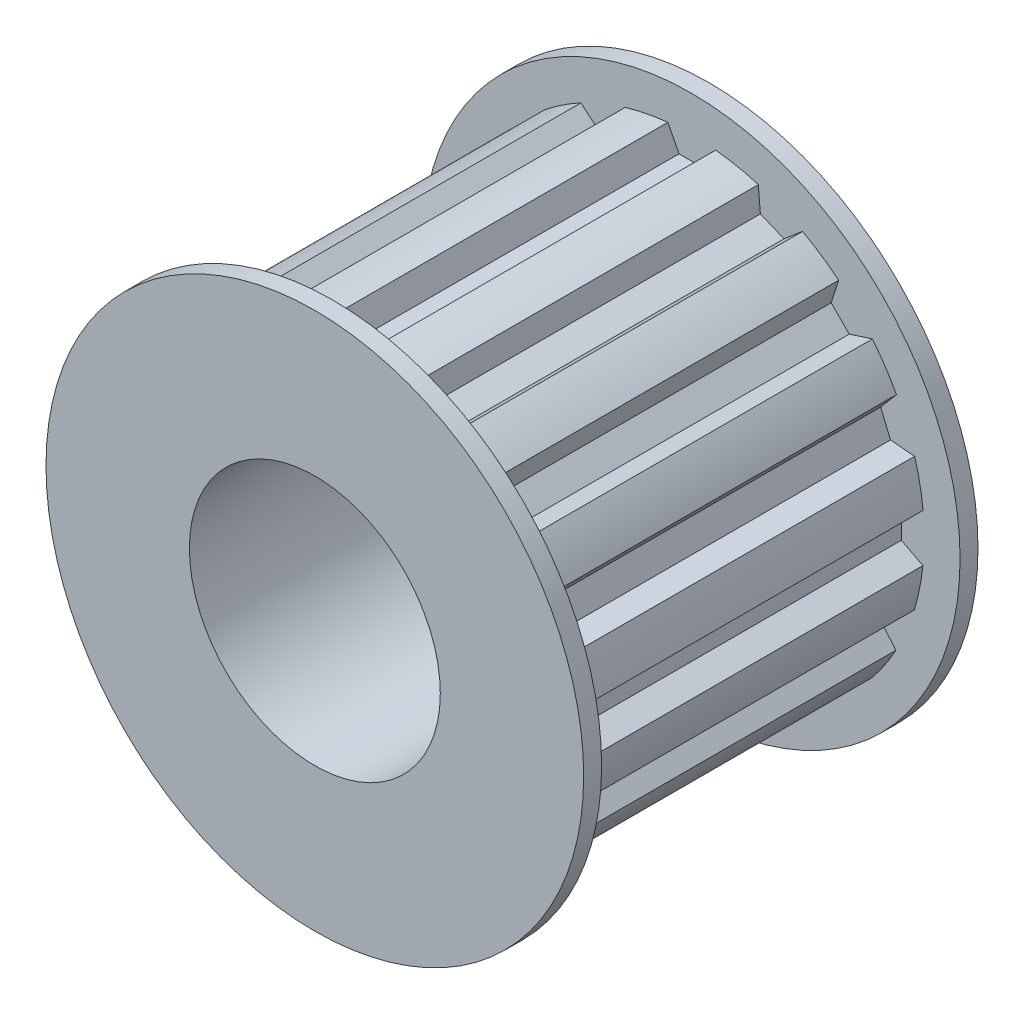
ISO-10303-21;
HEADER;
FILE_DESCRIPTION(('STEP AP214'),'2;1');
FILE_NAME('part.step','',(''),(''),'','','');
FILE_SCHEMA(('AUTOMOTIVE_DESIGN { 1 0 10303 214 1 1 1 1 }'));
ENDSEC;
DATA;
#1=APPLICATION_CONTEXT('core data for automotive mechanical design processes');
#2=APPLICATION_PROTOCOL_DEFINITION('international standard','automotive_design',2000,#1);
#3=PRODUCT_CONTEXT('',#1,'mechanical');
#4=PRODUCT('Part','Part','',(#3));
#5=PRODUCT_RELATED_PRODUCT_CATEGORY('part','',(#4));
#6=PRODUCT_DEFINITION_FORMATION('','',#4);
#7=PRODUCT_DEFINITION_CONTEXT('part definition',#1,'design');
#8=PRODUCT_DEFINITION('design','',#6,#7);
#9=PRODUCT_DEFINITION_SHAPE('','',#8);
#10=(LENGTH_UNIT() NAMED_UNIT(*) SI_UNIT(.MILLI.,.METRE.));
#11=(NAMED_UNIT(*) PLANE_ANGLE_UNIT() SI_UNIT($,.RADIAN.));
#12=(NAMED_UNIT(*) SI_UNIT($,.STERADIAN.) SOLID_ANGLE_UNIT());
#13=UNCERTAINTY_MEASURE_WITH_UNIT(LENGTH_MEASURE(1.E-05),#10,'distance_accuracy_value','');
#14=(GEOMETRIC_REPRESENTATION_CONTEXT(3) GLOBAL_UNCERTAINTY_ASSIGNED_CONTEXT((#13)) GLOBAL_UNIT_ASSIGNED_CONTEXT((#10,
#11,#12)) REPRESENTATION_CONTEXT('',''));
#15=CARTESIAN_POINT('',(0.,0.,0.));
#16=DIRECTION('',(0.,0.,1.));
#17=DIRECTION('',(1.,0.,0.));
#18=AXIS2_PLACEMENT_3D('',#15,#16,#17);
#19=CARTESIAN_POINT('',(0.,0.,20.));
#20=DIRECTION('',(0.,0.,-1.));
#21=DIRECTION('',(-1.,0.,0.));
#22=AXIS2_PLACEMENT_3D('',#19,#20,#21);
#23=CYLINDRICAL_SURFACE('',#22,13.);
#24=CARTESIAN_POINT('',(0.,0.,20.));
#25=DIRECTION('',(0.,0.,1.));
#26=DIRECTION('',(1.,0.,0.));
#27=AXIS2_PLACEMENT_3D('',#24,#25,#26);
#28=CIRCLE('',#27,13.);
#29=CARTESIAN_POINT('',(-6.15478941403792,11.4507016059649,20.));
#30=VERTEX_POINT('',#29);
#31=CARTESIAN_POINT('',(-8.17459026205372,10.1082181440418,20.));
#32=VERTEX_POINT('',#31);
#33=EDGE_CURVE('E884',#30,#32,#28,.T.);
#34=ORIENTED_EDGE('',*,*,#33,.F.);
#35=DIRECTION('',(0.,0.,-1.));
#36=VECTOR('',#35,1.);
#37=CARTESIAN_POINT('',(-6.15478941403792,11.4507016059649,20.));
#38=LINE('',#37,#36);
#39=CARTESIAN_POINT('',(-6.15478941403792,11.4507016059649,0.));
#40=VERTEX_POINT('',#39);
#41=EDGE_CURVE('E478',#30,#40,#38,.T.);
#42=ORIENTED_EDGE('',*,*,#41,.T.);
#43=CARTESIAN_POINT('',(0.,0.,0.));
#44=DIRECTION('',(0.,0.,1.));
#45=DIRECTION('',(1.,0.,0.));
#46=AXIS2_PLACEMENT_3D('',#43,#44,#45);
#47=CIRCLE('',#46,13.);
#48=CARTESIAN_POINT('',(-8.17459026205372,10.1082181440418,0.));
#49=VERTEX_POINT('',#48);
#50=EDGE_CURVE('E888',#40,#49,#47,.T.);
#51=ORIENTED_EDGE('',*,*,#50,.T.);
#52=DIRECTION('',(0.,0.,-1.));
#53=VECTOR('',#52,1.);
#54=CARTESIAN_POINT('',(-8.17459026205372,10.1082181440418,20.));
#55=LINE('',#54,#53);
#56=EDGE_CURVE('E497',#49,#32,#55,.F.);
#57=ORIENTED_EDGE('',*,*,#56,.T.);
#58=EDGE_LOOP('',(#34,#42,#51,#57));
#59=FACE_BOUND('',#58,.T.);
#60=ADVANCED_FACE('F35',(#59),#23,.T.);
#61=CARTESIAN_POINT('',(-10.0682777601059,8.22373290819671,20.));
#62=VERTEX_POINT('',#61);
#63=CARTESIAN_POINT('',(-11.4205842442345,6.2104955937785,20.));
#64=VERTEX_POINT('',#63);
#65=EDGE_CURVE('E938',#62,#64,#28,.T.);
#66=ORIENTED_EDGE('',*,*,#65,.F.);
#67=DIRECTION('',(0.,0.,-1.));
#68=VECTOR('',#67,1.);
#69=CARTESIAN_POINT('',(-10.0682777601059,8.22373290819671,20.));
#70=LINE('',#69,#68);
#71=CARTESIAN_POINT('',(-10.0682777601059,8.22373290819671,0.));
#72=VERTEX_POINT('',#71);
#73=EDGE_CURVE('E502',#62,#72,#70,.T.);
#74=ORIENTED_EDGE('',*,*,#73,.T.);
#75=CARTESIAN_POINT('',(-11.4205842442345,6.2104955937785,0.));
#76=VERTEX_POINT('',#75);
#77=EDGE_CURVE('E931',#72,#76,#47,.T.);
#78=ORIENTED_EDGE('',*,*,#77,.T.);
#79=DIRECTION('',(0.,0.,-1.));
#80=VECTOR('',#79,1.);
#81=CARTESIAN_POINT('',(-11.4205842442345,6.2104955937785,20.));
#82=LINE('',#81,#80);
#83=EDGE_CURVE('E521',#76,#64,#82,.F.);
#84=ORIENTED_EDGE('',*,*,#83,.T.);
#85=EDGE_LOOP('',(#66,#74,#78,#84));
#86=FACE_BOUND('',#85,.T.);
#87=ADVANCED_FACE('F937',(#86),#23,.T.);
#88=CARTESIAN_POINT('',(-12.4489620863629,3.74477542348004,20.));
#89=VERTEX_POINT('',#88);
#90=CARTESIAN_POINT('',(-12.9278978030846,1.36728138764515,20.));
#91=VERTEX_POINT('',#90);
#92=EDGE_CURVE('E940',#89,#91,#28,.T.);
#93=ORIENTED_EDGE('',*,*,#92,.F.);
#94=DIRECTION('',(0.,0.,-1.));
#95=VECTOR('',#94,1.);
#96=CARTESIAN_POINT('',(-12.4489620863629,3.74477542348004,20.));
#97=LINE('',#96,#95);
#98=CARTESIAN_POINT('',(-12.4489620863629,3.74477542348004,0.));
#99=VERTEX_POINT('',#98);
#100=EDGE_CURVE('E526',#89,#99,#97,.T.);
#101=ORIENTED_EDGE('',*,*,#100,.T.);
#102=CARTESIAN_POINT('',(-12.9278978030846,1.36728138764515,0.));
#103=VERTEX_POINT('',#102);
#104=EDGE_CURVE('E1015',#99,#103,#47,.T.);
#105=ORIENTED_EDGE('',*,*,#104,.T.);
#106=DIRECTION('',(0.,0.,-1.));
#107=VECTOR('',#106,1.);
#108=CARTESIAN_POINT('',(-12.9278978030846,1.36728138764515,20.));
#109=LINE('',#108,#107);
#110=EDGE_CURVE('E548',#103,#91,#109,.F.);
#111=ORIENTED_EDGE('',*,*,#110,.T.);
#112=EDGE_LOOP('',(#93,#101,#105,#111));
#113=FACE_BOUND('',#112,.T.);
#114=ADVANCED_FACE('F1044',(#113),#23,.T.);
#115=CARTESIAN_POINT('',(-12.9344047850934,-1.30429017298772,20.));
#116=VERTEX_POINT('',#115);
#117=CARTESIAN_POINT('',(-12.4670561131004,-3.68408901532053,20.));
#118=VERTEX_POINT('',#117);
#119=EDGE_CURVE('E941',#116,#118,#28,.T.);
#120=ORIENTED_EDGE('',*,*,#119,.F.);
#121=DIRECTION('',(0.,0.,-1.));
#122=VECTOR('',#121,1.);
#123=CARTESIAN_POINT('',(-12.9344047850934,-1.30429017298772,20.));
#124=LINE('',#123,#122);
#125=CARTESIAN_POINT('',(-12.9344047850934,-1.30429017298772,0.));
#126=VERTEX_POINT('',#125);
#127=EDGE_CURVE('E553',#116,#126,#124,.T.);
#128=ORIENTED_EDGE('',*,*,#127,.T.);
#129=CARTESIAN_POINT('',(-12.4670561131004,-3.68408901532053,0.));
#130=VERTEX_POINT('',#129);
#131=EDGE_CURVE('E1011',#126,#130,#47,.T.);
#132=ORIENTED_EDGE('',*,*,#131,.T.);
#133=DIRECTION('',(0.,0.,-1.));
#134=VECTOR('',#133,1.);
#135=CARTESIAN_POINT('',(-12.4670561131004,-3.68408901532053,20.));
#136=LINE('',#135,#134);
#137=EDGE_CURVE('E575',#130,#118,#136,.F.);
#138=ORIENTED_EDGE('',*,*,#137,.T.);
#139=EDGE_LOOP('',(#120,#128,#132,#138));
#140=FACE_BOUND('',#139,.T.);
#141=ADVANCED_FACE('F1361',(#140),#23,.T.);
#142=CARTESIAN_POINT('',(-11.4507016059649,-6.15478941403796,20.));
#143=VERTEX_POINT('',#142);
#144=CARTESIAN_POINT('',(-10.1082181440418,-8.17459026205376,20.));
#145=VERTEX_POINT('',#144);
#146=EDGE_CURVE('E943',#143,#145,#28,.T.);
#147=ORIENTED_EDGE('',*,*,#146,.F.);
#148=DIRECTION('',(0.,0.,-1.));
#149=VECTOR('',#148,1.);
#150=CARTESIAN_POINT('',(-11.4507016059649,-6.15478941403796,20.));
#151=LINE('',#150,#149);
#152=CARTESIAN_POINT('',(-11.4507016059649,-6.15478941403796,0.));
#153=VERTEX_POINT('',#152);
#154=EDGE_CURVE('E580',#143,#153,#151,.T.);
#155=ORIENTED_EDGE('',*,*,#154,.T.);
#156=CARTESIAN_POINT('',(-10.1082181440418,-8.17459026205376,0.));
#157=VERTEX_POINT('',#156);
#158=EDGE_CURVE('E1007',#153,#157,#47,.T.);
#159=ORIENTED_EDGE('',*,*,#158,.T.);
#160=DIRECTION('',(0.,0.,-1.));
#161=VECTOR('',#160,1.);
#162=CARTESIAN_POINT('',(-10.1082181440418,-8.17459026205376,20.));
#163=LINE('',#162,#161);
#164=EDGE_CURVE('E602',#157,#145,#163,.F.);
#165=ORIENTED_EDGE('',*,*,#164,.T.);
#166=EDGE_LOOP('',(#147,#155,#159,#165));
#167=FACE_BOUND('',#166,.T.);
#168=ADVANCED_FACE('F1369',(#167),#23,.T.);
#169=CARTESIAN_POINT('',(-8.22373290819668,-10.0682777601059,20.));
#170=VERTEX_POINT('',#169);
#171=CARTESIAN_POINT('',(-6.21049559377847,-11.4205842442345,20.));
#172=VERTEX_POINT('',#171);
#173=EDGE_CURVE('E945',#170,#172,#28,.T.);
#174=ORIENTED_EDGE('',*,*,#173,.F.);
#175=DIRECTION('',(0.,0.,-1.));
#176=VECTOR('',#175,1.);
#177=CARTESIAN_POINT('',(-8.22373290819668,-10.0682777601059,20.));
#178=LINE('',#177,#176);
#179=CARTESIAN_POINT('',(-8.22373290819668,-10.0682777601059,0.));
#180=VERTEX_POINT('',#179);
#181=EDGE_CURVE('E607',#170,#180,#178,.T.);
#182=ORIENTED_EDGE('',*,*,#181,.T.);
#183=CARTESIAN_POINT('',(-6.21049559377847,-11.4205842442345,0.));
#184=VERTEX_POINT('',#183);
#185=EDGE_CURVE('E1003',#180,#184,#47,.T.);
#186=ORIENTED_EDGE('',*,*,#185,.T.);
#187=DIRECTION('',(0.,0.,-1.));
#188=VECTOR('',#187,1.);
#189=CARTESIAN_POINT('',(-6.21049559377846,-11.4205842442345,20.));
#190=LINE('',#189,#188);
#191=EDGE_CURVE('E629',#184,#172,#190,.F.);
#192=ORIENTED_EDGE('',*,*,#191,.T.);
#193=EDGE_LOOP('',(#174,#182,#186,#192));
#194=FACE_BOUND('',#193,.T.);
#195=ADVANCED_FACE('F1377',(#194),#23,.T.);
#196=CARTESIAN_POINT('',(-3.74477542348,-12.4489620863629,20.));
#197=VERTEX_POINT('',#196);
#198=CARTESIAN_POINT('',(-1.36728138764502,-12.9278978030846,20.));
#199=VERTEX_POINT('',#198);
#200=EDGE_CURVE('E947',#197,#199,#28,.T.);
#201=ORIENTED_EDGE('',*,*,#200,.F.);
#202=DIRECTION('',(0.,0.,-1.));
#203=VECTOR('',#202,1.);
#204=CARTESIAN_POINT('',(-3.74477542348,-12.4489620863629,20.));
#205=LINE('',#204,#203);
#206=CARTESIAN_POINT('',(-3.74477542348,-12.4489620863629,0.));
#207=VERTEX_POINT('',#206);
#208=EDGE_CURVE('E634',#197,#207,#205,.T.);
#209=ORIENTED_EDGE('',*,*,#208,.T.);
#210=CARTESIAN_POINT('',(-1.36728138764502,-12.9278978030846,0.));
#211=VERTEX_POINT('',#210);
#212=EDGE_CURVE('E999',#207,#211,#47,.T.);
#213=ORIENTED_EDGE('',*,*,#212,.T.);
#214=DIRECTION('',(0.,0.,-1.));
#215=VECTOR('',#214,1.);
#216=CARTESIAN_POINT('',(-1.36728138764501,-12.9278978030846,20.));
#217=LINE('',#216,#215);
#218=EDGE_CURVE('E656',#211,#199,#217,.F.);
#219=ORIENTED_EDGE('',*,*,#218,.T.);
#220=EDGE_LOOP('',(#201,#209,#213,#219));
#221=FACE_BOUND('',#220,.T.);
#222=ADVANCED_FACE('F1385',(#221),#23,.T.);
#223=CARTESIAN_POINT('',(1.30429017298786,-12.9344047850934,20.));
#224=VERTEX_POINT('',#223);
#225=CARTESIAN_POINT('',(3.68408901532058,-12.4670561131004,20.));
#226=VERTEX_POINT('',#225);
#227=EDGE_CURVE('E949',#224,#226,#28,.T.);
#228=ORIENTED_EDGE('',*,*,#227,.F.);
#229=DIRECTION('',(0.,0.,-1.));
#230=VECTOR('',#229,1.);
#231=CARTESIAN_POINT('',(1.30429017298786,-12.9344047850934,20.));
#232=LINE('',#231,#230);
#233=CARTESIAN_POINT('',(1.30429017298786,-12.9344047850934,0.));
#234=VERTEX_POINT('',#233);
#235=EDGE_CURVE('E661',#224,#234,#232,.T.);
#236=ORIENTED_EDGE('',*,*,#235,.T.);
#237=CARTESIAN_POINT('',(3.68408901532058,-12.4670561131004,0.));
#238=VERTEX_POINT('',#237);
#239=EDGE_CURVE('E995',#234,#238,#47,.T.);
#240=ORIENTED_EDGE('',*,*,#239,.T.);
#241=DIRECTION('',(0.,0.,-1.));
#242=VECTOR('',#241,1.);
#243=CARTESIAN_POINT('',(3.68408901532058,-12.4670561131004,20.));
#244=LINE('',#243,#242);
#245=EDGE_CURVE('E683',#238,#226,#244,.F.);
#246=ORIENTED_EDGE('',*,*,#245,.T.);
#247=EDGE_LOOP('',(#228,#236,#240,#246));
#248=FACE_BOUND('',#247,.T.);
#249=ADVANCED_FACE('F1393',(#248),#23,.T.);
#250=CARTESIAN_POINT('',(6.15478941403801,-11.4507016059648,20.));
#251=VERTEX_POINT('',#250);
#252=CARTESIAN_POINT('',(8.17459026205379,-10.1082181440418,20.));
#253=VERTEX_POINT('',#252);
#254=EDGE_CURVE('E951',#251,#253,#28,.T.);
#255=ORIENTED_EDGE('',*,*,#254,.F.);
#256=DIRECTION('',(0.,0.,-1.));
#257=VECTOR('',#256,1.);
#258=CARTESIAN_POINT('',(6.154789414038,-11.4507016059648,20.));
#259=LINE('',#258,#257);
#260=CARTESIAN_POINT('',(6.154789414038,-11.4507016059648,0.));
#261=VERTEX_POINT('',#260);
#262=EDGE_CURVE('E688',#251,#261,#259,.T.);
#263=ORIENTED_EDGE('',*,*,#262,.T.);
#264=CARTESIAN_POINT('',(8.17459026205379,-10.1082181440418,0.));
#265=VERTEX_POINT('',#264);
#266=EDGE_CURVE('E991',#261,#265,#47,.T.);
#267=ORIENTED_EDGE('',*,*,#266,.T.);
#268=DIRECTION('',(0.,0.,-1.));
#269=VECTOR('',#268,1.);
#270=CARTESIAN_POINT('',(8.17459026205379,-10.1082181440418,20.));
#271=LINE('',#270,#269);
#272=EDGE_CURVE('E710',#265,#253,#271,.F.);
#273=ORIENTED_EDGE('',*,*,#272,.T.);
#274=EDGE_LOOP('',(#255,#263,#267,#273));
#275=FACE_BOUND('',#274,.T.);
#276=ADVANCED_FACE('F1401',(#275),#23,.T.);
#277=CARTESIAN_POINT('',(10.0682777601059,-8.22373290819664,20.));
#278=VERTEX_POINT('',#277);
#279=CARTESIAN_POINT('',(11.4205842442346,-6.21049559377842,20.));
#280=VERTEX_POINT('',#279);
#281=EDGE_CURVE('E953',#278,#280,#28,.T.);
#282=ORIENTED_EDGE('',*,*,#281,.F.);
#283=DIRECTION('',(0.,0.,-1.));
#284=VECTOR('',#283,1.);
#285=CARTESIAN_POINT('',(10.0682777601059,-8.22373290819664,20.));
#286=LINE('',#285,#284);
#287=CARTESIAN_POINT('',(10.0682777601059,-8.22373290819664,0.));
#288=VERTEX_POINT('',#287);
#289=EDGE_CURVE('E715',#278,#288,#286,.T.);
#290=ORIENTED_EDGE('',*,*,#289,.T.);
#291=CARTESIAN_POINT('',(11.4205842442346,-6.21049559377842,0.));
#292=VERTEX_POINT('',#291);
#293=EDGE_CURVE('E987',#288,#292,#47,.T.);
#294=ORIENTED_EDGE('',*,*,#293,.T.);
#295=DIRECTION('',(0.,0.,-1.));
#296=VECTOR('',#295,1.);
#297=CARTESIAN_POINT('',(11.4205842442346,-6.21049559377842,20.));
#298=LINE('',#297,#296);
#299=EDGE_CURVE('E737',#292,#280,#298,.F.);
#300=ORIENTED_EDGE('',*,*,#299,.T.);
#301=EDGE_LOOP('',(#282,#290,#294,#300));
#302=FACE_BOUND('',#301,.T.);
#303=ADVANCED_FACE('F1409',(#302),#23,.T.);
#304=CARTESIAN_POINT('',(12.4489620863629,-3.74477542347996,20.));
#305=VERTEX_POINT('',#304);
#306=CARTESIAN_POINT('',(12.9278978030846,-1.36728138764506,20.));
#307=VERTEX_POINT('',#306);
#308=EDGE_CURVE('E955',#305,#307,#28,.T.);
#309=ORIENTED_EDGE('',*,*,#308,.F.);
#310=DIRECTION('',(0.,0.,-1.));
#311=VECTOR('',#310,1.);
#312=CARTESIAN_POINT('',(12.4489620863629,-3.74477542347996,20.));
#313=LINE('',#312,#311);
#314=CARTESIAN_POINT('',(12.4489620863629,-3.74477542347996,0.));
#315=VERTEX_POINT('',#314);
#316=EDGE_CURVE('E742',#305,#315,#313,.T.);
#317=ORIENTED_EDGE('',*,*,#316,.T.);
#318=CARTESIAN_POINT('',(12.9278978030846,-1.36728138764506,0.));
#319=VERTEX_POINT('',#318);
#320=EDGE_CURVE('E983',#315,#319,#47,.T.);
#321=ORIENTED_EDGE('',*,*,#320,.T.);
#322=DIRECTION('',(0.,0.,-1.));
#323=VECTOR('',#322,1.);
#324=CARTESIAN_POINT('',(12.9278978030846,-1.36728138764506,20.));
#325=LINE('',#324,#323);
#326=EDGE_CURVE('E764',#319,#307,#325,.F.);
#327=ORIENTED_EDGE('',*,*,#326,.T.);
#328=EDGE_LOOP('',(#309,#317,#321,#327));
#329=FACE_BOUND('',#328,.T.);
#330=ADVANCED_FACE('F1417',(#329),#23,.T.);
#331=CARTESIAN_POINT('',(12.9344047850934,1.30429017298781,20.));
#332=VERTEX_POINT('',#331);
#333=CARTESIAN_POINT('',(12.4670561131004,3.68408901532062,20.));
#334=VERTEX_POINT('',#333);
#335=EDGE_CURVE('E957',#332,#334,#28,.T.);
#336=ORIENTED_EDGE('',*,*,#335,.F.);
#337=DIRECTION('',(0.,0.,-1.));
#338=VECTOR('',#337,1.);
#339=CARTESIAN_POINT('',(12.9344047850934,1.30429017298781,20.));
#340=LINE('',#339,#338);
#341=CARTESIAN_POINT('',(12.9344047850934,1.30429017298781,0.));
#342=VERTEX_POINT('',#341);
#343=EDGE_CURVE('E769',#332,#342,#340,.T.);
#344=ORIENTED_EDGE('',*,*,#343,.T.);
#345=CARTESIAN_POINT('',(12.4670561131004,3.68408901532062,0.));
#346=VERTEX_POINT('',#345);
#347=EDGE_CURVE('E979',#342,#346,#47,.T.);
#348=ORIENTED_EDGE('',*,*,#347,.T.);
#349=DIRECTION('',(0.,0.,-1.));
#350=VECTOR('',#349,1.);
#351=CARTESIAN_POINT('',(12.4670561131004,3.68408901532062,20.));
#352=LINE('',#351,#350);
#353=EDGE_CURVE('E791',#346,#334,#352,.F.);
#354=ORIENTED_EDGE('',*,*,#353,.T.);
#355=EDGE_LOOP('',(#336,#344,#348,#354));
#356=FACE_BOUND('',#355,.T.);
#357=ADVANCED_FACE('F1425',(#356),#23,.T.);
#358=CARTESIAN_POINT('',(11.4507016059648,6.15478941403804,20.));
#359=VERTEX_POINT('',#358);
#360=CARTESIAN_POINT('',(10.1082181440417,8.17459026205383,20.));
#361=VERTEX_POINT('',#360);
#362=EDGE_CURVE('E959',#359,#361,#28,.T.);
#363=ORIENTED_EDGE('',*,*,#362,.F.);
#364=DIRECTION('',(0.,0.,-1.));
#365=VECTOR('',#364,1.);
#366=CARTESIAN_POINT('',(11.4507016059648,6.15478941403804,20.));
#367=LINE('',#366,#365);
#368=CARTESIAN_POINT('',(11.4507016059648,6.15478941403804,0.));
#369=VERTEX_POINT('',#368);
#370=EDGE_CURVE('E796',#359,#369,#367,.T.);
#371=ORIENTED_EDGE('',*,*,#370,.T.);
#372=CARTESIAN_POINT('',(10.1082181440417,8.17459026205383,0.));
#373=VERTEX_POINT('',#372);
#374=EDGE_CURVE('E975',#369,#373,#47,.T.);
#375=ORIENTED_EDGE('',*,*,#374,.T.);
#376=DIRECTION('',(0.,0.,-1.));
#377=VECTOR('',#376,1.);
#378=CARTESIAN_POINT('',(10.1082181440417,8.17459026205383,20.));
#379=LINE('',#378,#377);
#380=EDGE_CURVE('E818',#373,#361,#379,.F.);
#381=ORIENTED_EDGE('',*,*,#380,.T.);
#382=EDGE_LOOP('',(#363,#371,#375,#381));
#383=FACE_BOUND('',#382,.T.);
#384=ADVANCED_FACE('F1433',(#383),#23,.T.);
#385=CARTESIAN_POINT('',(8.22373290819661,10.068277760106,20.));
#386=VERTEX_POINT('',#385);
#387=CARTESIAN_POINT('',(6.21049559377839,11.4205842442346,20.));
#388=VERTEX_POINT('',#387);
#389=EDGE_CURVE('E961',#386,#388,#28,.T.);
#390=ORIENTED_EDGE('',*,*,#389,.F.);
#391=DIRECTION('',(0.,0.,-1.));
#392=VECTOR('',#391,1.);
#393=CARTESIAN_POINT('',(8.22373290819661,10.068277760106,20.));
#394=LINE('',#393,#392);
#395=CARTESIAN_POINT('',(8.22373290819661,10.068277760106,0.));
#396=VERTEX_POINT('',#395);
#397=EDGE_CURVE('E823',#386,#396,#394,.T.);
#398=ORIENTED_EDGE('',*,*,#397,.T.);
#399=CARTESIAN_POINT('',(6.21049559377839,11.4205842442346,0.));
#400=VERTEX_POINT('',#399);
#401=EDGE_CURVE('E974',#396,#400,#47,.T.);
#402=ORIENTED_EDGE('',*,*,#401,.T.);
#403=DIRECTION('',(0.,0.,-1.));
#404=VECTOR('',#403,1.);
#405=CARTESIAN_POINT('',(6.21049559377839,11.4205842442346,20.));
#406=LINE('',#405,#404);
#407=EDGE_CURVE('E845',#400,#388,#406,.F.);
#408=ORIENTED_EDGE('',*,*,#407,.T.);
#409=EDGE_LOOP('',(#390,#398,#402,#408));
#410=FACE_BOUND('',#409,.T.);
#411=ADVANCED_FACE('F1053',(#410),#23,.T.);
#412=CARTESIAN_POINT('',(3.74477542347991,12.4489620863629,20.));
#413=VERTEX_POINT('',#412);
#414=CARTESIAN_POINT('',(1.36728138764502,12.9278978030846,20.));
#415=VERTEX_POINT('',#414);
#416=EDGE_CURVE('E885',#413,#415,#28,.T.);
#417=ORIENTED_EDGE('',*,*,#416,.F.);
#418=DIRECTION('',(0.,0.,-1.));
#419=VECTOR('',#418,1.);
#420=CARTESIAN_POINT('',(3.74477542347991,12.4489620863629,20.));
#421=LINE('',#420,#419);
#422=CARTESIAN_POINT('',(3.74477542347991,12.4489620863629,0.));
#423=VERTEX_POINT('',#422);
#424=EDGE_CURVE('E850',#413,#423,#421,.T.);
#425=ORIENTED_EDGE('',*,*,#424,.T.);
#426=CARTESIAN_POINT('',(1.36728138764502,12.9278978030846,0.));
#427=VERTEX_POINT('',#426);
#428=EDGE_CURVE('E880',#423,#427,#47,.T.);
#429=ORIENTED_EDGE('',*,*,#428,.T.);
#430=DIRECTION('',(0.,0.,-1.));
#431=VECTOR('',#430,1.);
#432=CARTESIAN_POINT('',(1.36728138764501,12.9278978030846,20.));
#433=LINE('',#432,#431);
#434=EDGE_CURVE('E872',#427,#415,#433,.F.);
#435=ORIENTED_EDGE('',*,*,#434,.T.);
#436=EDGE_LOOP('',(#417,#425,#429,#435));
#437=FACE_BOUND('',#436,.T.);
#438=ADVANCED_FACE('F972',(#437),#23,.T.);
#439=CARTESIAN_POINT('',(-1.30429017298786,12.9344047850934,0.));
#440=VERTEX_POINT('',#439);
#441=CARTESIAN_POINT('',(-3.68408901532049,12.4670561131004,0.));
#442=VERTEX_POINT('',#441);
#443=EDGE_CURVE('E886',#440,#442,#47,.T.);
#444=ORIENTED_EDGE('',*,*,#443,.T.);
#445=DIRECTION('',(0.,0.,-1.));
#446=VECTOR('',#445,1.);
#447=CARTESIAN_POINT('',(-3.68408901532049,12.4670561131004,20.));
#448=LINE('',#447,#446);
#449=CARTESIAN_POINT('',(-3.68408901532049,12.4670561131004,20.));
#450=VERTEX_POINT('',#449);
#451=EDGE_CURVE('E450',#442,#450,#448,.F.);
#452=ORIENTED_EDGE('',*,*,#451,.T.);
#453=CARTESIAN_POINT('',(-1.30429017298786,12.9344047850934,20.));
#454=VERTEX_POINT('',#453);
#455=EDGE_CURVE('E881',#454,#450,#28,.T.);
#456=ORIENTED_EDGE('',*,*,#455,.F.);
#457=DIRECTION('',(0.,0.,-1.));
#458=VECTOR('',#457,1.);
#459=CARTESIAN_POINT('',(-1.30429017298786,12.9344047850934,20.));
#460=LINE('',#459,#458);
#461=EDGE_CURVE('E877',#454,#440,#460,.T.);
#462=ORIENTED_EDGE('',*,*,#461,.T.);
#463=EDGE_LOOP('',(#444,#452,#456,#462));
#464=FACE_BOUND('',#463,.T.);
#465=ADVANCED_FACE('F37',(#464),#23,.T.);
#466=CARTESIAN_POINT('',(-1.46682879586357,13.2500045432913,0.));
#467=DIRECTION('',(-0.889023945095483,-0.457860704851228,0.));
#468=DIRECTION('',(0.457860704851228,-0.889023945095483,0.));
#469=AXIS2_PLACEMENT_3D('',#466,#467,#468);
#470=PLANE('',#469);
#471=DIRECTION('',(0.457860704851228,-0.889023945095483,0.));
#472=VECTOR('',#471,1.);
#473=CARTESIAN_POINT('',(-1.46682879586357,13.2500045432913,20.));
#474=LINE('',#473,#472);
#475=CARTESIAN_POINT('',(-0.680684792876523,11.7235559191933,20.));
#476=VERTEX_POINT('',#475);
#477=EDGE_CURVE('E853',#454,#476,#474,.T.);
#478=ORIENTED_EDGE('',*,*,#477,.T.);
#479=DIRECTION('',(0.,0.,1.));
#480=VECTOR('',#479,1.);
#481=CARTESIAN_POINT('',(-0.680684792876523,11.7235559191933,0.));
#482=LINE('',#481,#480);
#483=CARTESIAN_POINT('',(-0.680684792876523,11.7235559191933,0.));
#484=VERTEX_POINT('',#483);
#485=EDGE_CURVE('E861',#484,#476,#482,.T.);
#486=ORIENTED_EDGE('',*,*,#485,.F.);
#487=DIRECTION('',(0.457860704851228,-0.889023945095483,0.));
#488=VECTOR('',#487,1.);
#489=CARTESIAN_POINT('',(4.23407477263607,2.18061219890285,0.));
#490=LINE('',#489,#488);
#491=EDGE_CURVE('E883',#440,#484,#490,.T.);
#492=ORIENTED_EDGE('',*,*,#491,.F.);
#493=ORIENTED_EDGE('',*,*,#461,.F.);
#494=EDGE_LOOP('',(#478,#486,#492,#493));
#495=FACE_BOUND('',#494,.T.);
#496=ADVANCED_FACE('F1046',(#495),#470,.F.);
#497=CARTESIAN_POINT('',(1.53317120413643,13.2500045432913,0.));
#498=DIRECTION('',(0.889023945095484,-0.457860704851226,0.));
#499=DIRECTION('',(0.457860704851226,0.889023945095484,0.));
#500=AXIS2_PLACEMENT_3D('',#497,#498,#499);
#501=PLANE('',#500);
#502=DIRECTION('',(0.457860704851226,0.889023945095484,0.));
#503=VECTOR('',#502,1.);
#504=CARTESIAN_POINT('',(1.53317120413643,13.2500045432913,0.));
#505=LINE('',#504,#503);
#506=CARTESIAN_POINT('',(0.747027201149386,11.7235559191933,0.));
#507=VERTEX_POINT('',#506);
#508=EDGE_CURVE('E857',#507,#427,#505,.T.);
#509=ORIENTED_EDGE('',*,*,#508,.F.);
#510=DIRECTION('',(0.,0.,1.));
#511=VECTOR('',#510,1.);
#512=CARTESIAN_POINT('',(0.747027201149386,11.7235559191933,0.));
#513=LINE('',#512,#511);
#514=CARTESIAN_POINT('',(0.747027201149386,11.7235559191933,20.));
#515=VERTEX_POINT('',#514);
#516=EDGE_CURVE('E869',#507,#515,#513,.T.);
#517=ORIENTED_EDGE('',*,*,#516,.T.);
#518=DIRECTION('',(0.457860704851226,0.889023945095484,0.));
#519=VECTOR('',#518,1.);
#520=CARTESIAN_POINT('',(1.53317120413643,13.2500045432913,20.));
#521=LINE('',#520,#519);
#522=EDGE_CURVE('E858',#515,#415,#521,.T.);
#523=ORIENTED_EDGE('',*,*,#522,.T.);
#524=ORIENTED_EDGE('',*,*,#434,.F.);
#525=EDGE_LOOP('',(#509,#517,#523,#524));
#526=FACE_BOUND('',#525,.T.);
#527=ADVANCED_FACE('F970',(#526),#501,.F.);
#528=CARTESIAN_POINT('',(-0.680684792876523,11.7235559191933,0.));
#529=DIRECTION('',(0.,-1.,0.));
#530=DIRECTION('',(0.,0.,-1.));
#531=AXIS2_PLACEMENT_3D('',#528,#529,#530);
#532=PLANE('',#531);
#533=DIRECTION('',(1.,0.,0.));
#534=VECTOR('',#533,1.);
#535=CARTESIAN_POINT('',(-0.680684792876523,11.7235559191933,20.));
#536=LINE('',#535,#534);
#537=EDGE_CURVE('E864',#476,#515,#536,.T.);
#538=ORIENTED_EDGE('',*,*,#537,.T.);
#539=ORIENTED_EDGE('',*,*,#516,.F.);
#540=DIRECTION('',(1.,0.,0.));
#541=VECTOR('',#540,1.);
#542=CARTESIAN_POINT('',(-0.680684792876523,11.7235559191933,0.));
#543=LINE('',#542,#541);
#544=EDGE_CURVE('E854',#484,#507,#543,.T.);
#545=ORIENTED_EDGE('',*,*,#544,.F.);
#546=ORIENTED_EDGE('',*,*,#485,.T.);
#547=EDGE_LOOP('',(#538,#539,#545,#546));
#548=FACE_BOUND('',#547,.T.);
#549=ADVANCED_FACE('F1058',(#548),#532,.F.);
#550=CARTESIAN_POINT('',(3.71538411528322,12.8027390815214,0.));
#551=DIRECTION('',(-0.996566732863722,-0.0827933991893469,0.));
#552=DIRECTION('',(0.0827933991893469,-0.996566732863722,0.));
#553=AXIS2_PLACEMENT_3D('',#550,#551,#552);
#554=PLANE('',#553);
#555=DIRECTION('',(0.0827933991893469,-0.996566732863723,0.));
#556=VECTOR('',#555,1.);
#557=CARTESIAN_POINT('',(3.71538411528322,12.8027390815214,20.));
#558=LINE('',#557,#556);
#559=CARTESIAN_POINT('',(3.85753987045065,11.0916401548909,20.));
#560=VERTEX_POINT('',#559);
#561=EDGE_CURVE('E826',#413,#560,#558,.T.);
#562=ORIENTED_EDGE('',*,*,#561,.T.);
#563=DIRECTION('',(0.,0.,1.));
#564=VECTOR('',#563,1.);
#565=CARTESIAN_POINT('',(3.85753987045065,11.0916401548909,0.));
#566=LINE('',#565,#564);
#567=CARTESIAN_POINT('',(3.85753987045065,11.0916401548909,0.));
#568=VERTEX_POINT('',#567);
#569=EDGE_CURVE('E834',#568,#560,#566,.T.);
#570=ORIENTED_EDGE('',*,*,#569,.F.);
#571=DIRECTION('',(0.0827933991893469,-0.996566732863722,0.));
#572=VECTOR('',#571,1.);
#573=CARTESIAN_POINT('',(4.74625918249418,0.394312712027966,0.));
#574=LINE('',#573,#572);
#575=EDGE_CURVE('E891',#423,#568,#574,.T.);
#576=ORIENTED_EDGE('',*,*,#575,.F.);
#577=ORIENTED_EDGE('',*,*,#424,.F.);
#578=EDGE_LOOP('',(#562,#570,#576,#577));
#579=FACE_BOUND('',#578,.T.);
#580=ADVANCED_FACE('F1060',(#579),#554,.F.);
#581=CARTESIAN_POINT('',(6.48702271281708,11.6546887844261,0.));
#582=DIRECTION('',(0.646135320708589,-0.763222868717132,0.));
#583=DIRECTION('',(0.763222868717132,0.646135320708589,0.));
#584=AXIS2_PLACEMENT_3D('',#581,#582,#583);
#585=PLANE('',#584);
#586=DIRECTION('',(0.763222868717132,0.646135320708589,0.));
#587=VECTOR('',#586,1.);
#588=CARTESIAN_POINT('',(6.48702271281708,11.6546887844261,0.));
#589=LINE('',#588,#587);
#590=CARTESIAN_POINT('',(5.17657376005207,10.5452784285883,0.));
#591=VERTEX_POINT('',#590);
#592=EDGE_CURVE('E830',#591,#400,#589,.T.);
#593=ORIENTED_EDGE('',*,*,#592,.F.);
#594=DIRECTION('',(0.,0.,1.));
#595=VECTOR('',#594,1.);
#596=CARTESIAN_POINT('',(5.17657376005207,10.5452784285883,0.));
#597=LINE('',#596,#595);
#598=CARTESIAN_POINT('',(5.17657376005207,10.5452784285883,20.));
#599=VERTEX_POINT('',#598);
#600=EDGE_CURVE('E842',#591,#599,#597,.T.);
#601=ORIENTED_EDGE('',*,*,#600,.T.);
#602=DIRECTION('',(0.763222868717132,0.646135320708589,0.));
#603=VECTOR('',#602,1.);
#604=CARTESIAN_POINT('',(6.48702271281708,11.6546887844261,20.));
#605=LINE('',#604,#603);
#606=EDGE_CURVE('E831',#599,#388,#605,.T.);
#607=ORIENTED_EDGE('',*,*,#606,.T.);
#608=ORIENTED_EDGE('',*,*,#407,.F.);
#609=EDGE_LOOP('',(#593,#601,#607,#608));
#610=FACE_BOUND('',#609,.T.);
#611=ADVANCED_FACE('F1066',(#610),#585,.F.);
#612=CARTESIAN_POINT('',(3.85753987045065,11.0916401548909,0.));
#613=DIRECTION('',(-0.382683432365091,-0.923879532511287,0.));
#614=DIRECTION('',(0.923879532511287,-0.382683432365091,0.));
#615=AXIS2_PLACEMENT_3D('',#612,#613,#614);
#616=PLANE('',#615);
#617=DIRECTION('',(0.923879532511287,-0.382683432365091,0.));
#618=VECTOR('',#617,1.);
#619=CARTESIAN_POINT('',(3.85753987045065,11.0916401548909,20.));
#620=LINE('',#619,#618);
#621=EDGE_CURVE('E837',#560,#599,#620,.T.);
#622=ORIENTED_EDGE('',*,*,#621,.T.);
#623=ORIENTED_EDGE('',*,*,#600,.F.);
#624=DIRECTION('',(0.923879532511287,-0.382683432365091,0.));
#625=VECTOR('',#624,1.);
#626=CARTESIAN_POINT('',(3.85753987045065,11.0916401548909,0.));
#627=LINE('',#626,#625);
#628=EDGE_CURVE('E827',#568,#591,#627,.T.);
#629=ORIENTED_EDGE('',*,*,#628,.F.);
#630=ORIENTED_EDGE('',*,*,#569,.T.);
#631=EDGE_LOOP('',(#622,#623,#629,#630));
#632=FACE_BOUND('',#631,.T.);
#633=ADVANCED_FACE('F1071',(#632),#616,.F.);
#634=CARTESIAN_POINT('',(8.33196347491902,10.4063726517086,0.));
#635=DIRECTION('',(-0.952391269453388,0.304878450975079,0.));
#636=DIRECTION('',(-0.304878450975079,-0.952391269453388,0.));
#637=AXIS2_PLACEMENT_3D('',#634,#635,#636);
#638=PLANE('',#637);
#639=DIRECTION('',(-0.304878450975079,-0.952391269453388,0.));
#640=VECTOR('',#639,1.);
#641=CARTESIAN_POINT('',(8.33196347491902,10.4063726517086,20.));
#642=LINE('',#641,#640);
#643=CARTESIAN_POINT('',(7.80848905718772,8.77112272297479,20.));
#644=VERTEX_POINT('',#643);
#645=EDGE_CURVE('E799',#386,#644,#642,.T.);
#646=ORIENTED_EDGE('',*,*,#645,.T.);
#647=DIRECTION('',(0.,0.,1.));
#648=VECTOR('',#647,1.);
#649=CARTESIAN_POINT('',(7.80848905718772,8.77112272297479,0.));
#650=LINE('',#649,#648);
#651=CARTESIAN_POINT('',(7.80848905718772,8.77112272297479,0.));
#652=VERTEX_POINT('',#651);
#653=EDGE_CURVE('E807',#652,#644,#650,.T.);
#654=ORIENTED_EDGE('',*,*,#653,.F.);
#655=DIRECTION('',(-0.304878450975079,-0.952391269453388,0.));
#656=VECTOR('',#655,1.);
#657=CARTESIAN_POINT('',(4.53586865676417,-1.45201731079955,0.));
#658=LINE('',#657,#656);
#659=EDGE_CURVE('E894',#396,#652,#658,.T.);
#660=ORIENTED_EDGE('',*,*,#659,.F.);
#661=ORIENTED_EDGE('',*,*,#397,.F.);
#662=EDGE_LOOP('',(#646,#654,#660,#661));
#663=FACE_BOUND('',#662,.T.);
#664=ADVANCED_FACE('F1074',(#663),#638,.F.);
#665=CARTESIAN_POINT('',(10.4532838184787,8.285052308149,0.));
#666=DIRECTION('',(0.304878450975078,-0.952391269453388,0.));
#667=DIRECTION('',(0.952391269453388,0.304878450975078,0.));
#668=AXIS2_PLACEMENT_3D('',#665,#666,#667);
#669=PLANE('',#668);
#670=DIRECTION('',(0.952391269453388,0.304878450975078,0.));
#671=VECTOR('',#670,1.);
#672=CARTESIAN_POINT('',(10.4532838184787,8.285052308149,0.));
#673=LINE('',#672,#671);
#674=CARTESIAN_POINT('',(8.8180338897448,7.7615778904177,0.));
#675=VERTEX_POINT('',#674);
#676=EDGE_CURVE('E803',#675,#373,#673,.T.);
#677=ORIENTED_EDGE('',*,*,#676,.F.);
#678=DIRECTION('',(0.,0.,1.));
#679=VECTOR('',#678,1.);
#680=CARTESIAN_POINT('',(8.8180338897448,7.7615778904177,0.));
#681=LINE('',#680,#679);
#682=CARTESIAN_POINT('',(8.8180338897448,7.7615778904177,20.));
#683=VERTEX_POINT('',#682);
#684=EDGE_CURVE('E815',#675,#683,#681,.T.);
#685=ORIENTED_EDGE('',*,*,#684,.T.);
#686=DIRECTION('',(0.952391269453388,0.304878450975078,0.));
#687=VECTOR('',#686,1.);
#688=CARTESIAN_POINT('',(10.4532838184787,8.285052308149,20.));
#689=LINE('',#688,#687);
#690=EDGE_CURVE('E804',#683,#361,#689,.T.);
#691=ORIENTED_EDGE('',*,*,#690,.T.);
#692=ORIENTED_EDGE('',*,*,#380,.F.);
#693=EDGE_LOOP('',(#677,#685,#691,#692));
#694=FACE_BOUND('',#693,.T.);
#695=ADVANCED_FACE('F1081',(#694),#669,.F.);
#696=CARTESIAN_POINT('',(7.80848905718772,8.77112272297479,0.));
#697=DIRECTION('',(-0.707106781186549,-0.707106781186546,0.));
#698=DIRECTION('',(0.707106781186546,-0.707106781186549,0.));
#699=AXIS2_PLACEMENT_3D('',#696,#697,#698);
#700=PLANE('',#699);
#701=DIRECTION('',(0.707106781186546,-0.707106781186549,0.));
#702=VECTOR('',#701,1.);
#703=CARTESIAN_POINT('',(7.80848905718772,8.77112272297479,20.));
#704=LINE('',#703,#702);
#705=EDGE_CURVE('E810',#644,#683,#704,.T.);
#706=ORIENTED_EDGE('',*,*,#705,.T.);
#707=ORIENTED_EDGE('',*,*,#684,.F.);
#708=DIRECTION('',(0.707106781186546,-0.707106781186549,0.));
#709=VECTOR('',#708,1.);
#710=CARTESIAN_POINT('',(7.80848905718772,8.77112272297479,0.));
#711=LINE('',#710,#709);
#712=EDGE_CURVE('E800',#652,#675,#711,.T.);
#713=ORIENTED_EDGE('',*,*,#712,.F.);
#714=ORIENTED_EDGE('',*,*,#653,.T.);
#715=EDGE_LOOP('',(#706,#707,#713,#714));
#716=FACE_BOUND('',#715,.T.);
#717=ADVANCED_FACE('F1083',(#716),#700,.F.);
#718=CARTESIAN_POINT('',(11.6800769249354,6.42573031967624,0.));
#719=DIRECTION('',(-0.763222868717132,0.64613532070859,0.));
#720=DIRECTION('',(-0.64613532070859,-0.763222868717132,0.));
#721=AXIS2_PLACEMENT_3D('',#718,#719,#720);
#722=PLANE('',#721);
#723=DIRECTION('',(-0.64613532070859,-0.763222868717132,0.));
#724=VECTOR('',#723,1.);
#725=CARTESIAN_POINT('',(11.6800769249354,6.42573031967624,20.));
#726=LINE('',#725,#724);
#727=CARTESIAN_POINT('',(10.5706665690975,5.11528136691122,20.));
#728=VERTEX_POINT('',#727);
#729=EDGE_CURVE('E772',#359,#728,#726,.T.);
#730=ORIENTED_EDGE('',*,*,#729,.T.);
#731=DIRECTION('',(0.,0.,1.));
#732=VECTOR('',#731,1.);
#733=CARTESIAN_POINT('',(10.5706665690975,5.11528136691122,0.));
#734=LINE('',#733,#732);
#735=CARTESIAN_POINT('',(10.5706665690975,5.11528136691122,0.));
#736=VERTEX_POINT('',#735);
#737=EDGE_CURVE('E780',#736,#728,#734,.T.);
#738=ORIENTED_EDGE('',*,*,#737,.F.);
#739=DIRECTION('',(-0.64613532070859,-0.763222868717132,0.));
#740=VECTOR('',#739,1.);
#741=CARTESIAN_POINT('',(3.63493324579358,-3.07729086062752,0.));
#742=LINE('',#741,#740);
#743=EDGE_CURVE('E897',#369,#736,#742,.T.);
#744=ORIENTED_EDGE('',*,*,#743,.F.);
#745=ORIENTED_EDGE('',*,*,#370,.F.);
#746=EDGE_LOOP('',(#730,#738,#744,#745));
#747=FACE_BOUND('',#746,.T.);
#748=ADVANCED_FACE('F1086',(#747),#722,.F.);
#749=CARTESIAN_POINT('',(12.8281272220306,3.65409172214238,0.));
#750=DIRECTION('',(-0.082793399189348,-0.996566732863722,0.));
#751=DIRECTION('',(0.996566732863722,-0.082793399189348,0.));
#752=AXIS2_PLACEMENT_3D('',#749,#750,#751);
#753=PLANE('',#752);
#754=DIRECTION('',(0.996566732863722,-0.082793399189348,0.));
#755=VECTOR('',#754,1.);
#756=CARTESIAN_POINT('',(12.8281272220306,3.65409172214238,0.));
#757=LINE('',#756,#755);
#758=CARTESIAN_POINT('',(11.1170282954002,3.79624747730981,0.));
#759=VERTEX_POINT('',#758);
#760=EDGE_CURVE('E776',#759,#346,#757,.T.);
#761=ORIENTED_EDGE('',*,*,#760,.F.);
#762=DIRECTION('',(0.,0.,1.));
#763=VECTOR('',#762,1.);
#764=CARTESIAN_POINT('',(11.1170282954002,3.79624747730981,0.));
#765=LINE('',#764,#763);
#766=CARTESIAN_POINT('',(11.1170282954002,3.79624747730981,20.));
#767=VERTEX_POINT('',#766);
#768=EDGE_CURVE('E788',#759,#767,#765,.T.);
#769=ORIENTED_EDGE('',*,*,#768,.T.);
#770=DIRECTION('',(0.996566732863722,-0.082793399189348,0.));
#771=VECTOR('',#770,1.);
#772=CARTESIAN_POINT('',(12.8281272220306,3.65409172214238,20.));
#773=LINE('',#772,#771);
#774=EDGE_CURVE('E777',#767,#334,#773,.T.);
#775=ORIENTED_EDGE('',*,*,#774,.T.);
#776=ORIENTED_EDGE('',*,*,#353,.F.);
#777=EDGE_LOOP('',(#761,#769,#775,#776));
#778=FACE_BOUND('',#777,.T.);
#779=ADVANCED_FACE('F1093',(#778),#753,.F.);
#780=CARTESIAN_POINT('',(10.5706665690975,5.11528136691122,0.));
#781=DIRECTION('',(-0.923879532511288,-0.382683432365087,0.));
#782=DIRECTION('',(0.382683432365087,-0.923879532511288,0.));
#783=AXIS2_PLACEMENT_3D('',#780,#781,#782);
#784=PLANE('',#783);
#785=DIRECTION('',(0.382683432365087,-0.923879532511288,0.));
#786=VECTOR('',#785,1.);
#787=CARTESIAN_POINT('',(10.5706665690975,5.11528136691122,20.));
#788=LINE('',#787,#786);
#789=EDGE_CURVE('E783',#728,#767,#788,.T.);
#790=ORIENTED_EDGE('',*,*,#789,.T.);
#791=ORIENTED_EDGE('',*,*,#768,.F.);
#792=DIRECTION('',(0.382683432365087,-0.923879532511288,0.));
#793=VECTOR('',#792,1.);
#794=CARTESIAN_POINT('',(10.5706665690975,5.11528136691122,0.));
#795=LINE('',#794,#793);
#796=EDGE_CURVE('E773',#736,#759,#795,.T.);
#797=ORIENTED_EDGE('',*,*,#796,.F.);
#798=ORIENTED_EDGE('',*,*,#737,.T.);
#799=EDGE_LOOP('',(#790,#791,#797,#798));
#800=FACE_BOUND('',#799,.T.);
#801=ADVANCED_FACE('F1095',(#800),#784,.F.);
#802=CARTESIAN_POINT('',(13.2500045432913,1.46682879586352,0.));
#803=DIRECTION('',(-0.457860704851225,0.889023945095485,0.));
#804=DIRECTION('',(-0.889023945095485,-0.457860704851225,0.));
#805=AXIS2_PLACEMENT_3D('',#802,#803,#804);
#806=PLANE('',#805);
#807=DIRECTION('',(-0.889023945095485,-0.457860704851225,0.));
#808=VECTOR('',#807,1.);
#809=CARTESIAN_POINT('',(13.2500045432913,1.46682879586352,20.));
#810=LINE('',#809,#808);
#811=CARTESIAN_POINT('',(11.7235559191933,0.680684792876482,20.));
#812=VERTEX_POINT('',#811);
#813=EDGE_CURVE('E745',#332,#812,#810,.T.);
#814=ORIENTED_EDGE('',*,*,#813,.T.);
#815=DIRECTION('',(0.,0.,1.));
#816=VECTOR('',#815,1.);
#817=CARTESIAN_POINT('',(11.7235559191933,0.680684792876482,0.));
#818=LINE('',#817,#816);
#819=CARTESIAN_POINT('',(11.7235559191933,0.680684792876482,0.));
#820=VERTEX_POINT('',#819);
#821=EDGE_CURVE('E753',#820,#812,#818,.T.);
#822=ORIENTED_EDGE('',*,*,#821,.F.);
#823=DIRECTION('',(-0.889023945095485,-0.457860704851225,0.));
#824=VECTOR('',#823,1.);
#825=CARTESIAN_POINT('',(2.18061219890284,-4.23407477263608,0.));
#826=LINE('',#825,#824);
#827=EDGE_CURVE('E900',#342,#820,#826,.T.);
#828=ORIENTED_EDGE('',*,*,#827,.F.);
#829=ORIENTED_EDGE('',*,*,#343,.F.);
#830=EDGE_LOOP('',(#814,#822,#828,#829));
#831=FACE_BOUND('',#830,.T.);
#832=ADVANCED_FACE('F1098',(#831),#806,.F.);
#833=CARTESIAN_POINT('',(13.2500045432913,-1.53317120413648,0.));
#834=DIRECTION('',(-0.457860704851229,-0.889023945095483,0.));
#835=DIRECTION('',(0.889023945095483,-0.457860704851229,0.));
#836=AXIS2_PLACEMENT_3D('',#833,#834,#835);
#837=PLANE('',#836);
#838=DIRECTION('',(0.889023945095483,-0.457860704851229,0.));
#839=VECTOR('',#838,1.);
#840=CARTESIAN_POINT('',(13.2500045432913,-1.53317120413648,0.));
#841=LINE('',#840,#839);
#842=CARTESIAN_POINT('',(11.7235559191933,-0.747027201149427,0.));
#843=VERTEX_POINT('',#842);
#844=EDGE_CURVE('E749',#843,#319,#841,.T.);
#845=ORIENTED_EDGE('',*,*,#844,.F.);
#846=DIRECTION('',(0.,0.,1.));
#847=VECTOR('',#846,1.);
#848=CARTESIAN_POINT('',(11.7235559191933,-0.747027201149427,0.));
#849=LINE('',#848,#847);
#850=CARTESIAN_POINT('',(11.7235559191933,-0.747027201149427,20.));
#851=VERTEX_POINT('',#850);
#852=EDGE_CURVE('E761',#843,#851,#849,.T.);
#853=ORIENTED_EDGE('',*,*,#852,.T.);
#854=DIRECTION('',(0.889023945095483,-0.457860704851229,0.));
#855=VECTOR('',#854,1.);
#856=CARTESIAN_POINT('',(13.2500045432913,-1.53317120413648,20.));
#857=LINE('',#856,#855);
#858=EDGE_CURVE('E750',#851,#307,#857,.T.);
#859=ORIENTED_EDGE('',*,*,#858,.T.);
#860=ORIENTED_EDGE('',*,*,#326,.F.);
#861=EDGE_LOOP('',(#845,#853,#859,#860));
#862=FACE_BOUND('',#861,.T.);
#863=ADVANCED_FACE('F1105',(#862),#837,.F.);
#864=CARTESIAN_POINT('',(11.7235559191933,0.680684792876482,0.));
#865=DIRECTION('',(-1.,0.,0.));
#866=DIRECTION('',(0.,-1.,0.));
#867=AXIS2_PLACEMENT_3D('',#864,#865,#866);
#868=PLANE('',#867);
#869=DIRECTION('',(0.,-1.,0.));
#870=VECTOR('',#869,1.);
#871=CARTESIAN_POINT('',(11.7235559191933,0.680684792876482,20.));
#872=LINE('',#871,#870);
#873=EDGE_CURVE('E756',#812,#851,#872,.T.);
#874=ORIENTED_EDGE('',*,*,#873,.T.);
#875=ORIENTED_EDGE('',*,*,#852,.F.);
#876=DIRECTION('',(0.,-1.,0.));
#877=VECTOR('',#876,1.);
#878=CARTESIAN_POINT('',(11.7235559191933,0.680684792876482,0.));
#879=LINE('',#878,#877);
#880=EDGE_CURVE('E746',#820,#843,#879,.T.);
#881=ORIENTED_EDGE('',*,*,#880,.F.);
#882=ORIENTED_EDGE('',*,*,#821,.T.);
#883=EDGE_LOOP('',(#874,#875,#881,#882));
#884=FACE_BOUND('',#883,.T.);
#885=ADVANCED_FACE('F1107',(#884),#868,.F.);
#886=CARTESIAN_POINT('',(12.8027390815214,-3.71538411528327,0.));
#887=DIRECTION('',(-0.0827933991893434,0.996566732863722,0.));
#888=DIRECTION('',(-0.996566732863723,-0.0827933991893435,0.));
#889=AXIS2_PLACEMENT_3D('',#886,#887,#888);
#890=PLANE('',#889);
#891=DIRECTION('',(-0.996566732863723,-0.0827933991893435,0.));
#892=VECTOR('',#891,1.);
#893=CARTESIAN_POINT('',(12.8027390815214,-3.71538411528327,20.));
#894=LINE('',#893,#892);
#895=CARTESIAN_POINT('',(11.0916401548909,-3.85753987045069,20.));
#896=VERTEX_POINT('',#895);
#897=EDGE_CURVE('E718',#305,#896,#894,.T.);
#898=ORIENTED_EDGE('',*,*,#897,.T.);
#899=DIRECTION('',(0.,0.,1.));
#900=VECTOR('',#899,1.);
#901=CARTESIAN_POINT('',(11.0916401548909,-3.85753987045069,0.));
#902=LINE('',#901,#900);
#903=CARTESIAN_POINT('',(11.0916401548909,-3.85753987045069,0.));
#904=VERTEX_POINT('',#903);
#905=EDGE_CURVE('E726',#904,#896,#902,.T.);
#906=ORIENTED_EDGE('',*,*,#905,.F.);
#907=DIRECTION('',(-0.996566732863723,-0.0827933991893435,0.));
#908=VECTOR('',#907,1.);
#909=CARTESIAN_POINT('',(0.394312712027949,-4.74625918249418,0.));
#910=LINE('',#909,#908);
#911=EDGE_CURVE('E903',#315,#904,#910,.T.);
#912=ORIENTED_EDGE('',*,*,#911,.F.);
#913=ORIENTED_EDGE('',*,*,#316,.F.);
#914=EDGE_LOOP('',(#898,#906,#912,#913));
#915=FACE_BOUND('',#914,.T.);
#916=ADVANCED_FACE('F1110',(#915),#890,.F.);
#917=CARTESIAN_POINT('',(11.6546887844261,-6.48702271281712,0.));
#918=DIRECTION('',(-0.763222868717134,-0.646135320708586,0.));
#919=DIRECTION('',(0.646135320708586,-0.763222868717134,0.));
#920=AXIS2_PLACEMENT_3D('',#917,#918,#919);
#921=PLANE('',#920);
#922=DIRECTION('',(0.646135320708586,-0.763222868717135,0.));
#923=VECTOR('',#922,1.);
#924=CARTESIAN_POINT('',(11.6546887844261,-6.48702271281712,0.));
#925=LINE('',#924,#923);
#926=CARTESIAN_POINT('',(10.5452784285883,-5.1765737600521,0.));
#927=VERTEX_POINT('',#926);
#928=EDGE_CURVE('E722',#927,#292,#925,.T.);
#929=ORIENTED_EDGE('',*,*,#928,.F.);
#930=DIRECTION('',(0.,0.,1.));
#931=VECTOR('',#930,1.);
#932=CARTESIAN_POINT('',(10.5452784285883,-5.1765737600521,0.));
#933=LINE('',#932,#931);
#934=CARTESIAN_POINT('',(10.5452784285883,-5.1765737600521,20.));
#935=VERTEX_POINT('',#934);
#936=EDGE_CURVE('E734',#927,#935,#933,.T.);
#937=ORIENTED_EDGE('',*,*,#936,.T.);
#938=DIRECTION('',(0.646135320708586,-0.763222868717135,0.));
#939=VECTOR('',#938,1.);
#940=CARTESIAN_POINT('',(11.6546887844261,-6.48702271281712,20.));
#941=LINE('',#940,#939);
#942=EDGE_CURVE('E723',#935,#280,#941,.T.);
#943=ORIENTED_EDGE('',*,*,#942,.T.);
#944=ORIENTED_EDGE('',*,*,#299,.F.);
#945=EDGE_LOOP('',(#929,#937,#943,#944));
#946=FACE_BOUND('',#945,.T.);
#947=ADVANCED_FACE('F1117',(#946),#921,.F.);
#948=CARTESIAN_POINT('',(11.0916401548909,-3.85753987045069,0.));
#949=DIRECTION('',(-0.923879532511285,0.382683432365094,0.));
#950=DIRECTION('',(-0.382683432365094,-0.923879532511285,0.));
#951=AXIS2_PLACEMENT_3D('',#948,#949,#950);
#952=PLANE('',#951);
#953=DIRECTION('',(-0.382683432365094,-0.923879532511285,0.));
#954=VECTOR('',#953,1.);
#955=CARTESIAN_POINT('',(11.0916401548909,-3.85753987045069,20.));
#956=LINE('',#955,#954);
#957=EDGE_CURVE('E729',#896,#935,#956,.T.);
#958=ORIENTED_EDGE('',*,*,#957,.T.);
#959=ORIENTED_EDGE('',*,*,#936,.F.);
#960=DIRECTION('',(-0.382683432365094,-0.923879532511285,0.));
#961=VECTOR('',#960,1.);
#962=CARTESIAN_POINT('',(11.0916401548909,-3.85753987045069,0.));
#963=LINE('',#962,#961);
#964=EDGE_CURVE('E719',#904,#927,#963,.T.);
#965=ORIENTED_EDGE('',*,*,#964,.F.);
#966=ORIENTED_EDGE('',*,*,#905,.T.);
#967=EDGE_LOOP('',(#958,#959,#965,#966));
#968=FACE_BOUND('',#967,.T.);
#969=ADVANCED_FACE('F1119',(#968),#952,.F.);
#970=CARTESIAN_POINT('',(10.4063726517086,-8.33196347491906,0.));
#971=DIRECTION('',(0.304878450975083,0.952391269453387,0.));
#972=DIRECTION('',(-0.952391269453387,0.304878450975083,0.));
#973=AXIS2_PLACEMENT_3D('',#970,#971,#972);
#974=PLANE('',#973);
#975=DIRECTION('',(-0.952391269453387,0.304878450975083,0.));
#976=VECTOR('',#975,1.);
#977=CARTESIAN_POINT('',(10.4063726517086,-8.33196347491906,20.));
#978=LINE('',#977,#976);
#979=CARTESIAN_POINT('',(8.77112272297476,-7.80848905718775,20.));
#980=VERTEX_POINT('',#979);
#981=EDGE_CURVE('E691',#278,#980,#978,.T.);
#982=ORIENTED_EDGE('',*,*,#981,.T.);
#983=DIRECTION('',(0.,0.,1.));
#984=VECTOR('',#983,1.);
#985=CARTESIAN_POINT('',(8.77112272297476,-7.80848905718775,0.));
#986=LINE('',#985,#984);
#987=CARTESIAN_POINT('',(8.77112272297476,-7.80848905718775,0.));
#988=VERTEX_POINT('',#987);
#989=EDGE_CURVE('E699',#988,#980,#986,.T.);
#990=ORIENTED_EDGE('',*,*,#989,.F.);
#991=DIRECTION('',(-0.952391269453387,0.304878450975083,0.));
#992=VECTOR('',#991,1.);
#993=CARTESIAN_POINT('',(-1.45201731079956,-4.53586865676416,0.));
#994=LINE('',#993,#992);
#995=EDGE_CURVE('E906',#288,#988,#994,.T.);
#996=ORIENTED_EDGE('',*,*,#995,.F.);
#997=ORIENTED_EDGE('',*,*,#289,.F.);
#998=EDGE_LOOP('',(#982,#990,#996,#997));
#999=FACE_BOUND('',#998,.T.);
#1000=ADVANCED_FACE('F1122',(#999),#974,.F.);
#1001=CARTESIAN_POINT('',(8.28505230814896,-10.4532838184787,0.));
#1002=DIRECTION('',(-0.952391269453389,-0.304878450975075,0.));
#1003=DIRECTION('',(0.304878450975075,-0.95239126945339,0.));
#1004=AXIS2_PLACEMENT_3D('',#1001,#1002,#1003);
#1005=PLANE('',#1004);
#1006=DIRECTION('',(0.304878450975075,-0.952391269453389,0.));
#1007=VECTOR('',#1006,1.);
#1008=CARTESIAN_POINT('',(8.28505230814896,-10.4532838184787,0.));
#1009=LINE('',#1008,#1007);
#1010=CARTESIAN_POINT('',(7.76157789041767,-8.81803388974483,0.));
#1011=VERTEX_POINT('',#1010);
#1012=EDGE_CURVE('E695',#1011,#265,#1009,.T.);
#1013=ORIENTED_EDGE('',*,*,#1012,.F.);
#1014=DIRECTION('',(0.,0.,1.));
#1015=VECTOR('',#1014,1.);
#1016=CARTESIAN_POINT('',(7.76157789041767,-8.81803388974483,0.));
#1017=LINE('',#1016,#1015);
#1018=CARTESIAN_POINT('',(7.76157789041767,-8.81803388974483,20.));
#1019=VERTEX_POINT('',#1018);
#1020=EDGE_CURVE('E707',#1011,#1019,#1017,.T.);
#1021=ORIENTED_EDGE('',*,*,#1020,.T.);
#1022=DIRECTION('',(0.304878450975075,-0.952391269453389,0.));
#1023=VECTOR('',#1022,1.);
#1024=CARTESIAN_POINT('',(8.28505230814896,-10.4532838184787,20.));
#1025=LINE('',#1024,#1023);
#1026=EDGE_CURVE('E696',#1019,#253,#1025,.T.);
#1027=ORIENTED_EDGE('',*,*,#1026,.T.);
#1028=ORIENTED_EDGE('',*,*,#272,.F.);
#1029=EDGE_LOOP('',(#1013,#1021,#1027,#1028));
#1030=FACE_BOUND('',#1029,.T.);
#1031=ADVANCED_FACE('F1129',(#1030),#1005,.F.);
#1032=CARTESIAN_POINT('',(8.77112272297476,-7.80848905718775,0.));
#1033=DIRECTION('',(-0.707106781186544,0.707106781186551,0.));
#1034=DIRECTION('',(-0.707106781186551,-0.707106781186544,0.));
#1035=AXIS2_PLACEMENT_3D('',#1032,#1033,#1034);
#1036=PLANE('',#1035);
#1037=DIRECTION('',(-0.707106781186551,-0.707106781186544,0.));
#1038=VECTOR('',#1037,1.);
#1039=CARTESIAN_POINT('',(8.77112272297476,-7.80848905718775,20.));
#1040=LINE('',#1039,#1038);
#1041=EDGE_CURVE('E702',#980,#1019,#1040,.T.);
#1042=ORIENTED_EDGE('',*,*,#1041,.T.);
#1043=ORIENTED_EDGE('',*,*,#1020,.F.);
#1044=DIRECTION('',(-0.707106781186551,-0.707106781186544,0.));
#1045=VECTOR('',#1044,1.);
#1046=CARTESIAN_POINT('',(8.77112272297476,-7.80848905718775,0.));
#1047=LINE('',#1046,#1045);
#1048=EDGE_CURVE('E692',#988,#1011,#1047,.T.);
#1049=ORIENTED_EDGE('',*,*,#1048,.F.);
#1050=ORIENTED_EDGE('',*,*,#989,.T.);
#1051=EDGE_LOOP('',(#1042,#1043,#1049,#1050));
#1052=FACE_BOUND('',#1051,.T.);
#1053=ADVANCED_FACE('F1131',(#1052),#1036,.F.);
#1054=CARTESIAN_POINT('',(6.4257303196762,-11.6800769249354,0.));
#1055=DIRECTION('',(0.646135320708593,0.763222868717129,0.));
#1056=DIRECTION('',(-0.763222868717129,0.646135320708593,0.));
#1057=AXIS2_PLACEMENT_3D('',#1054,#1055,#1056);
#1058=PLANE('',#1057);
#1059=DIRECTION('',(-0.763222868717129,0.646135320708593,0.));
#1060=VECTOR('',#1059,1.);
#1061=CARTESIAN_POINT('',(6.4257303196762,-11.6800769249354,20.));
#1062=LINE('',#1061,#1060);
#1063=CARTESIAN_POINT('',(5.11528136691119,-10.5706665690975,20.));
#1064=VERTEX_POINT('',#1063);
#1065=EDGE_CURVE('E664',#251,#1064,#1062,.T.);
#1066=ORIENTED_EDGE('',*,*,#1065,.T.);
#1067=DIRECTION('',(0.,0.,1.));
#1068=VECTOR('',#1067,1.);
#1069=CARTESIAN_POINT('',(5.11528136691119,-10.5706665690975,0.));
#1070=LINE('',#1069,#1068);
#1071=CARTESIAN_POINT('',(5.11528136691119,-10.5706665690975,0.));
#1072=VERTEX_POINT('',#1071);
#1073=EDGE_CURVE('E672',#1072,#1064,#1070,.T.);
#1074=ORIENTED_EDGE('',*,*,#1073,.F.);
#1075=DIRECTION('',(-0.763222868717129,0.646135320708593,0.));
#1076=VECTOR('',#1075,1.);
#1077=CARTESIAN_POINT('',(-3.07729086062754,-3.63493324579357,0.));
#1078=LINE('',#1077,#1076);
#1079=EDGE_CURVE('E909',#261,#1072,#1078,.T.);
#1080=ORIENTED_EDGE('',*,*,#1079,.F.);
#1081=ORIENTED_EDGE('',*,*,#262,.F.);
#1082=EDGE_LOOP('',(#1066,#1074,#1080,#1081));
#1083=FACE_BOUND('',#1082,.T.);
#1084=ADVANCED_FACE('F1134',(#1083),#1058,.F.);
#1085=CARTESIAN_POINT('',(3.65409172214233,-12.8281272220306,0.));
#1086=DIRECTION('',(-0.996566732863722,0.0827933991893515,0.));
#1087=DIRECTION('',(-0.0827933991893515,-0.996566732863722,0.));
#1088=AXIS2_PLACEMENT_3D('',#1085,#1086,#1087);
#1089=PLANE('',#1088);
#1090=DIRECTION('',(-0.0827933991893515,-0.996566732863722,0.));
#1091=VECTOR('',#1090,1.);
#1092=CARTESIAN_POINT('',(3.65409172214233,-12.8281272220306,0.));
#1093=LINE('',#1092,#1091);
#1094=CARTESIAN_POINT('',(3.79624747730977,-11.1170282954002,0.));
#1095=VERTEX_POINT('',#1094);
#1096=EDGE_CURVE('E668',#1095,#238,#1093,.T.);
#1097=ORIENTED_EDGE('',*,*,#1096,.F.);
#1098=DIRECTION('',(0.,0.,1.));
#1099=VECTOR('',#1098,1.);
#1100=CARTESIAN_POINT('',(3.79624747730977,-11.1170282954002,0.));
#1101=LINE('',#1100,#1099);
#1102=CARTESIAN_POINT('',(3.79624747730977,-11.1170282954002,20.));
#1103=VERTEX_POINT('',#1102);
#1104=EDGE_CURVE('E680',#1095,#1103,#1101,.T.);
#1105=ORIENTED_EDGE('',*,*,#1104,.T.);
#1106=DIRECTION('',(-0.0827933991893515,-0.996566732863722,0.));
#1107=VECTOR('',#1106,1.);
#1108=CARTESIAN_POINT('',(3.65409172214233,-12.8281272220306,20.));
#1109=LINE('',#1108,#1107);
#1110=EDGE_CURVE('E669',#1103,#226,#1109,.T.);
#1111=ORIENTED_EDGE('',*,*,#1110,.T.);
#1112=ORIENTED_EDGE('',*,*,#245,.F.);
#1113=EDGE_LOOP('',(#1097,#1105,#1111,#1112));
#1114=FACE_BOUND('',#1113,.T.);
#1115=ADVANCED_FACE('F1141',(#1114),#1089,.F.);
#1116=CARTESIAN_POINT('',(5.11528136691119,-10.5706665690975,0.));
#1117=DIRECTION('',(-0.382683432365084,0.923879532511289,0.));
#1118=DIRECTION('',(-0.923879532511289,-0.382683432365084,0.));
#1119=AXIS2_PLACEMENT_3D('',#1116,#1117,#1118);
#1120=PLANE('',#1119);
#1121=DIRECTION('',(-0.923879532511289,-0.382683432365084,0.));
#1122=VECTOR('',#1121,1.);
#1123=CARTESIAN_POINT('',(5.11528136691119,-10.5706665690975,20.));
#1124=LINE('',#1123,#1122);
#1125=EDGE_CURVE('E675',#1064,#1103,#1124,.T.);
#1126=ORIENTED_EDGE('',*,*,#1125,.T.);
#1127=ORIENTED_EDGE('',*,*,#1104,.F.);
#1128=DIRECTION('',(-0.923879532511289,-0.382683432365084,0.));
#1129=VECTOR('',#1128,1.);
#1130=CARTESIAN_POINT('',(5.11528136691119,-10.5706665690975,0.));
#1131=LINE('',#1130,#1129);
#1132=EDGE_CURVE('E665',#1072,#1095,#1131,.T.);
#1133=ORIENTED_EDGE('',*,*,#1132,.F.);
#1134=ORIENTED_EDGE('',*,*,#1073,.T.);
#1135=EDGE_LOOP('',(#1126,#1127,#1133,#1134));
#1136=FACE_BOUND('',#1135,.T.);
#1137=ADVANCED_FACE('F1143',(#1136),#1120,.F.);
#1138=CARTESIAN_POINT('',(1.46682879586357,-13.2500045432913,0.));
#1139=DIRECTION('',(0.889023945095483,0.457860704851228,0.));
#1140=DIRECTION('',(-0.457860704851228,0.889023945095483,0.));
#1141=AXIS2_PLACEMENT_3D('',#1138,#1139,#1140);
#1142=PLANE('',#1141);
#1143=DIRECTION('',(-0.457860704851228,0.889023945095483,0.));
#1144=VECTOR('',#1143,1.);
#1145=CARTESIAN_POINT('',(1.46682879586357,-13.2500045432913,20.));
#1146=LINE('',#1145,#1144);
#1147=CARTESIAN_POINT('',(0.680684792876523,-11.7235559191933,20.));
#1148=VERTEX_POINT('',#1147);
#1149=EDGE_CURVE('E637',#224,#1148,#1146,.T.);
#1150=ORIENTED_EDGE('',*,*,#1149,.T.);
#1151=DIRECTION('',(0.,0.,1.));
#1152=VECTOR('',#1151,1.);
#1153=CARTESIAN_POINT('',(0.680684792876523,-11.7235559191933,0.));
#1154=LINE('',#1153,#1152);
#1155=CARTESIAN_POINT('',(0.680684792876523,-11.7235559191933,0.));
#1156=VERTEX_POINT('',#1155);
#1157=EDGE_CURVE('E645',#1156,#1148,#1154,.T.);
#1158=ORIENTED_EDGE('',*,*,#1157,.F.);
#1159=DIRECTION('',(-0.457860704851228,0.889023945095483,0.));
#1160=VECTOR('',#1159,1.);
#1161=CARTESIAN_POINT('',(-4.23407477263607,-2.18061219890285,0.));
#1162=LINE('',#1161,#1160);
#1163=EDGE_CURVE('E911',#234,#1156,#1162,.T.);
#1164=ORIENTED_EDGE('',*,*,#1163,.F.);
#1165=ORIENTED_EDGE('',*,*,#235,.F.);
#1166=EDGE_LOOP('',(#1150,#1158,#1164,#1165));
#1167=FACE_BOUND('',#1166,.T.);
#1168=ADVANCED_FACE('F1146',(#1167),#1142,.F.);
#1169=CARTESIAN_POINT('',(-1.53317120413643,-13.2500045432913,0.));
#1170=DIRECTION('',(-0.889023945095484,0.457860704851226,0.));
#1171=DIRECTION('',(-0.457860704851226,-0.889023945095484,0.));
#1172=AXIS2_PLACEMENT_3D('',#1169,#1170,#1171);
#1173=PLANE('',#1172);
#1174=DIRECTION('',(-0.457860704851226,-0.889023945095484,0.));
#1175=VECTOR('',#1174,1.);
#1176=CARTESIAN_POINT('',(-1.53317120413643,-13.2500045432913,0.));
#1177=LINE('',#1176,#1175);
#1178=CARTESIAN_POINT('',(-0.747027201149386,-11.7235559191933,0.));
#1179=VERTEX_POINT('',#1178);
#1180=EDGE_CURVE('E641',#1179,#211,#1177,.T.);
#1181=ORIENTED_EDGE('',*,*,#1180,.F.);
#1182=DIRECTION('',(0.,0.,1.));
#1183=VECTOR('',#1182,1.);
#1184=CARTESIAN_POINT('',(-0.747027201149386,-11.7235559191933,0.));
#1185=LINE('',#1184,#1183);
#1186=CARTESIAN_POINT('',(-0.747027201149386,-11.7235559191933,20.));
#1187=VERTEX_POINT('',#1186);
#1188=EDGE_CURVE('E653',#1179,#1187,#1185,.T.);
#1189=ORIENTED_EDGE('',*,*,#1188,.T.);
#1190=DIRECTION('',(-0.457860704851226,-0.889023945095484,0.));
#1191=VECTOR('',#1190,1.);
#1192=CARTESIAN_POINT('',(-1.53317120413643,-13.2500045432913,20.));
#1193=LINE('',#1192,#1191);
#1194=EDGE_CURVE('E642',#1187,#199,#1193,.T.);
#1195=ORIENTED_EDGE('',*,*,#1194,.T.);
#1196=ORIENTED_EDGE('',*,*,#218,.F.);
#1197=EDGE_LOOP('',(#1181,#1189,#1195,#1196));
#1198=FACE_BOUND('',#1197,.T.);
#1199=ADVANCED_FACE('F1153',(#1198),#1173,.F.);
#1200=CARTESIAN_POINT('',(0.680684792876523,-11.7235559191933,0.));
#1201=DIRECTION('',(0.,1.,0.));
#1202=DIRECTION('',(0.,0.,1.));
#1203=AXIS2_PLACEMENT_3D('',#1200,#1201,#1202);
#1204=PLANE('',#1203);
#1205=DIRECTION('',(-1.,0.,0.));
#1206=VECTOR('',#1205,1.);
#1207=CARTESIAN_POINT('',(0.680684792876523,-11.7235559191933,20.));
#1208=LINE('',#1207,#1206);
#1209=EDGE_CURVE('E648',#1148,#1187,#1208,.T.);
#1210=ORIENTED_EDGE('',*,*,#1209,.T.);
#1211=ORIENTED_EDGE('',*,*,#1188,.F.);
#1212=DIRECTION('',(-1.,0.,0.));
#1213=VECTOR('',#1212,1.);
#1214=CARTESIAN_POINT('',(0.680684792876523,-11.7235559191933,0.));
#1215=LINE('',#1214,#1213);
#1216=EDGE_CURVE('E638',#1156,#1179,#1215,.T.);
#1217=ORIENTED_EDGE('',*,*,#1216,.F.);
#1218=ORIENTED_EDGE('',*,*,#1157,.T.);
#1219=EDGE_LOOP('',(#1210,#1211,#1217,#1218));
#1220=FACE_BOUND('',#1219,.T.);
#1221=ADVANCED_FACE('F1155',(#1220),#1204,.F.);
#1222=CARTESIAN_POINT('',(-3.71538411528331,-12.8027390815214,0.));
#1223=DIRECTION('',(0.996566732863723,0.0827933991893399,0.));
#1224=DIRECTION('',(-0.0827933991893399,0.996566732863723,0.));
#1225=AXIS2_PLACEMENT_3D('',#1222,#1223,#1224);
#1226=PLANE('',#1225);
#1227=DIRECTION('',(-0.0827933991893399,0.996566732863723,0.));
#1228=VECTOR('',#1227,1.);
#1229=CARTESIAN_POINT('',(-3.71538411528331,-12.8027390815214,20.));
#1230=LINE('',#1229,#1228);
#1231=CARTESIAN_POINT('',(-3.85753987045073,-11.0916401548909,20.));
#1232=VERTEX_POINT('',#1231);
#1233=EDGE_CURVE('E610',#197,#1232,#1230,.T.);
#1234=ORIENTED_EDGE('',*,*,#1233,.T.);
#1235=DIRECTION('',(0.,0.,1.));
#1236=VECTOR('',#1235,1.);
#1237=CARTESIAN_POINT('',(-3.85753987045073,-11.0916401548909,0.));
#1238=LINE('',#1237,#1236);
#1239=CARTESIAN_POINT('',(-3.85753987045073,-11.0916401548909,0.));
#1240=VERTEX_POINT('',#1239);
#1241=EDGE_CURVE('E618',#1240,#1232,#1238,.T.);
#1242=ORIENTED_EDGE('',*,*,#1241,.F.);
#1243=DIRECTION('',(-0.0827933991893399,0.996566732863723,0.));
#1244=VECTOR('',#1243,1.);
#1245=CARTESIAN_POINT('',(-4.74625918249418,-0.394312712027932,0.));
#1246=LINE('',#1245,#1244);
#1247=EDGE_CURVE('E914',#207,#1240,#1246,.T.);
#1248=ORIENTED_EDGE('',*,*,#1247,.F.);
#1249=ORIENTED_EDGE('',*,*,#208,.F.);
#1250=EDGE_LOOP('',(#1234,#1242,#1248,#1249));
#1251=FACE_BOUND('',#1250,.T.);
#1252=ADVANCED_FACE('F1158',(#1251),#1226,.F.);
#1253=CARTESIAN_POINT('',(-6.48702271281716,-11.6546887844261,0.));
#1254=DIRECTION('',(-0.646135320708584,0.763222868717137,0.));
#1255=DIRECTION('',(-0.763222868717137,-0.646135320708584,0.));
#1256=AXIS2_PLACEMENT_3D('',#1253,#1254,#1255);
#1257=PLANE('',#1256);
#1258=DIRECTION('',(-0.763222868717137,-0.646135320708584,0.));
#1259=VECTOR('',#1258,1.);
#1260=CARTESIAN_POINT('',(-6.48702271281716,-11.6546887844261,0.));
#1261=LINE('',#1260,#1259);
#1262=CARTESIAN_POINT('',(-5.17657376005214,-10.5452784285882,0.));
#1263=VERTEX_POINT('',#1262);
#1264=EDGE_CURVE('E614',#1263,#184,#1261,.T.);
#1265=ORIENTED_EDGE('',*,*,#1264,.F.);
#1266=DIRECTION('',(0.,0.,1.));
#1267=VECTOR('',#1266,1.);
#1268=CARTESIAN_POINT('',(-5.17657376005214,-10.5452784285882,0.));
#1269=LINE('',#1268,#1267);
#1270=CARTESIAN_POINT('',(-5.17657376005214,-10.5452784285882,20.));
#1271=VERTEX_POINT('',#1270);
#1272=EDGE_CURVE('E626',#1263,#1271,#1269,.T.);
#1273=ORIENTED_EDGE('',*,*,#1272,.T.);
#1274=DIRECTION('',(-0.763222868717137,-0.646135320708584,0.));
#1275=VECTOR('',#1274,1.);
#1276=CARTESIAN_POINT('',(-6.48702271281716,-11.6546887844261,20.));
#1277=LINE('',#1276,#1275);
#1278=EDGE_CURVE('E615',#1271,#172,#1277,.T.);
#1279=ORIENTED_EDGE('',*,*,#1278,.T.);
#1280=ORIENTED_EDGE('',*,*,#191,.F.);
#1281=EDGE_LOOP('',(#1265,#1273,#1279,#1280));
#1282=FACE_BOUND('',#1281,.T.);
#1283=ADVANCED_FACE('F1165',(#1282),#1257,.F.);
#1284=CARTESIAN_POINT('',(-3.85753987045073,-11.0916401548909,0.));
#1285=DIRECTION('',(0.382683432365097,0.923879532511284,0.));
#1286=DIRECTION('',(-0.923879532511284,0.382683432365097,0.));
#1287=AXIS2_PLACEMENT_3D('',#1284,#1285,#1286);
#1288=PLANE('',#1287);
#1289=DIRECTION('',(-0.923879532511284,0.382683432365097,0.));
#1290=VECTOR('',#1289,1.);
#1291=CARTESIAN_POINT('',(-3.85753987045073,-11.0916401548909,20.));
#1292=LINE('',#1291,#1290);
#1293=EDGE_CURVE('E621',#1232,#1271,#1292,.T.);
#1294=ORIENTED_EDGE('',*,*,#1293,.T.);
#1295=ORIENTED_EDGE('',*,*,#1272,.F.);
#1296=DIRECTION('',(-0.923879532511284,0.382683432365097,0.));
#1297=VECTOR('',#1296,1.);
#1298=CARTESIAN_POINT('',(-3.85753987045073,-11.0916401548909,0.));
#1299=LINE('',#1298,#1297);
#1300=EDGE_CURVE('E611',#1240,#1263,#1299,.T.);
#1301=ORIENTED_EDGE('',*,*,#1300,.F.);
#1302=ORIENTED_EDGE('',*,*,#1241,.T.);
#1303=EDGE_LOOP('',(#1294,#1295,#1301,#1302));
#1304=FACE_BOUND('',#1303,.T.);
#1305=ADVANCED_FACE('F1167',(#1304),#1288,.F.);
#1306=CARTESIAN_POINT('',(-8.33196347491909,-10.4063726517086,0.));
#1307=DIRECTION('',(0.952391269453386,-0.304878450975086,0.));
#1308=DIRECTION('',(0.304878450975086,0.952391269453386,0.));
#1309=AXIS2_PLACEMENT_3D('',#1306,#1307,#1308);
#1310=PLANE('',#1309);
#1311=DIRECTION('',(0.304878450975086,0.952391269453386,0.));
#1312=VECTOR('',#1311,1.);
#1313=CARTESIAN_POINT('',(-8.33196347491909,-10.4063726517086,20.));
#1314=LINE('',#1313,#1312);
#1315=CARTESIAN_POINT('',(-7.80848905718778,-8.77112272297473,20.));
#1316=VERTEX_POINT('',#1315);
#1317=EDGE_CURVE('E583',#170,#1316,#1314,.T.);
#1318=ORIENTED_EDGE('',*,*,#1317,.T.);
#1319=DIRECTION('',(0.,0.,1.));
#1320=VECTOR('',#1319,1.);
#1321=CARTESIAN_POINT('',(-7.80848905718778,-8.77112272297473,0.));
#1322=LINE('',#1321,#1320);
#1323=CARTESIAN_POINT('',(-7.80848905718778,-8.77112272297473,0.));
#1324=VERTEX_POINT('',#1323);
#1325=EDGE_CURVE('E591',#1324,#1316,#1322,.T.);
#1326=ORIENTED_EDGE('',*,*,#1325,.F.);
#1327=DIRECTION('',(0.304878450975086,0.952391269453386,0.));
#1328=VECTOR('',#1327,1.);
#1329=CARTESIAN_POINT('',(-4.53586865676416,1.45201731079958,0.));
#1330=LINE('',#1329,#1328);
#1331=EDGE_CURVE('E917',#180,#1324,#1330,.T.);
#1332=ORIENTED_EDGE('',*,*,#1331,.F.);
#1333=ORIENTED_EDGE('',*,*,#181,.F.);
#1334=EDGE_LOOP('',(#1318,#1326,#1332,#1333));
#1335=FACE_BOUND('',#1334,.T.);
#1336=ADVANCED_FACE('F1170',(#1335),#1310,.F.);
#1337=CARTESIAN_POINT('',(-10.4532838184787,-8.28505230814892,0.));
#1338=DIRECTION('',(-0.304878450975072,0.952391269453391,0.));
#1339=DIRECTION('',(-0.952391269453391,-0.304878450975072,0.));
#1340=AXIS2_PLACEMENT_3D('',#1337,#1338,#1339);
#1341=PLANE('',#1340);
#1342=DIRECTION('',(-0.95239126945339,-0.304878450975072,0.));
#1343=VECTOR('',#1342,1.);
#1344=CARTESIAN_POINT('',(-10.4532838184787,-8.28505230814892,0.));
#1345=LINE('',#1344,#1343);
#1346=CARTESIAN_POINT('',(-8.81803388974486,-7.76157789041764,0.));
#1347=VERTEX_POINT('',#1346);
#1348=EDGE_CURVE('E587',#1347,#157,#1345,.T.);
#1349=ORIENTED_EDGE('',*,*,#1348,.F.);
#1350=DIRECTION('',(0.,0.,1.));
#1351=VECTOR('',#1350,1.);
#1352=CARTESIAN_POINT('',(-8.81803388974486,-7.76157789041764,0.));
#1353=LINE('',#1352,#1351);
#1354=CARTESIAN_POINT('',(-8.81803388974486,-7.76157789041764,20.));
#1355=VERTEX_POINT('',#1354);
#1356=EDGE_CURVE('E599',#1347,#1355,#1353,.T.);
#1357=ORIENTED_EDGE('',*,*,#1356,.T.);
#1358=DIRECTION('',(-0.95239126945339,-0.304878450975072,0.));
#1359=VECTOR('',#1358,1.);
#1360=CARTESIAN_POINT('',(-10.4532838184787,-8.28505230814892,20.));
#1361=LINE('',#1360,#1359);
#1362=EDGE_CURVE('E588',#1355,#145,#1361,.T.);
#1363=ORIENTED_EDGE('',*,*,#1362,.T.);
#1364=ORIENTED_EDGE('',*,*,#164,.F.);
#1365=EDGE_LOOP('',(#1349,#1357,#1363,#1364));
#1366=FACE_BOUND('',#1365,.T.);
#1367=ADVANCED_FACE('F1177',(#1366),#1341,.F.);
#1368=CARTESIAN_POINT('',(-7.80848905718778,-8.77112272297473,0.));
#1369=DIRECTION('',(0.707106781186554,0.707106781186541,0.));
#1370=DIRECTION('',(-0.707106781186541,0.707106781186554,0.));
#1371=AXIS2_PLACEMENT_3D('',#1368,#1369,#1370);
#1372=PLANE('',#1371);
#1373=DIRECTION('',(-0.707106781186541,0.707106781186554,0.));
#1374=VECTOR('',#1373,1.);
#1375=CARTESIAN_POINT('',(-7.80848905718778,-8.77112272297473,20.));
#1376=LINE('',#1375,#1374);
#1377=EDGE_CURVE('E594',#1316,#1355,#1376,.T.);
#1378=ORIENTED_EDGE('',*,*,#1377,.T.);
#1379=ORIENTED_EDGE('',*,*,#1356,.F.);
#1380=DIRECTION('',(-0.707106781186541,0.707106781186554,0.));
#1381=VECTOR('',#1380,1.);
#1382=CARTESIAN_POINT('',(-7.80848905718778,-8.77112272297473,0.));
#1383=LINE('',#1382,#1381);
#1384=EDGE_CURVE('E584',#1324,#1347,#1383,.T.);
#1385=ORIENTED_EDGE('',*,*,#1384,.F.);
#1386=ORIENTED_EDGE('',*,*,#1325,.T.);
#1387=EDGE_LOOP('',(#1378,#1379,#1385,#1386));
#1388=FACE_BOUND('',#1387,.T.);
#1389=ADVANCED_FACE('F1179',(#1388),#1372,.F.);
#1390=CARTESIAN_POINT('',(-11.6800769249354,-6.42573031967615,0.));
#1391=DIRECTION('',(0.763222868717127,-0.646135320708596,0.));
#1392=DIRECTION('',(0.646135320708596,0.763222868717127,0.));
#1393=AXIS2_PLACEMENT_3D('',#1390,#1391,#1392);
#1394=PLANE('',#1393);
#1395=DIRECTION('',(0.646135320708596,0.763222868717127,0.));
#1396=VECTOR('',#1395,1.);
#1397=CARTESIAN_POINT('',(-11.6800769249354,-6.42573031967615,20.));
#1398=LINE('',#1397,#1396);
#1399=CARTESIAN_POINT('',(-10.5706665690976,-5.11528136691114,20.));
#1400=VERTEX_POINT('',#1399);
#1401=EDGE_CURVE('E556',#143,#1400,#1398,.T.);
#1402=ORIENTED_EDGE('',*,*,#1401,.T.);
#1403=DIRECTION('',(0.,0.,1.));
#1404=VECTOR('',#1403,1.);
#1405=CARTESIAN_POINT('',(-10.5706665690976,-5.11528136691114,0.));
#1406=LINE('',#1405,#1404);
#1407=CARTESIAN_POINT('',(-10.5706665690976,-5.11528136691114,0.));
#1408=VERTEX_POINT('',#1407);
#1409=EDGE_CURVE('E564',#1408,#1400,#1406,.T.);
#1410=ORIENTED_EDGE('',*,*,#1409,.F.);
#1411=DIRECTION('',(0.646135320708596,0.763222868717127,0.));
#1412=VECTOR('',#1411,1.);
#1413=CARTESIAN_POINT('',(-3.63493324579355,3.07729086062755,0.));
#1414=LINE('',#1413,#1412);
#1415=EDGE_CURVE('E920',#153,#1408,#1414,.T.);
#1416=ORIENTED_EDGE('',*,*,#1415,.F.);
#1417=ORIENTED_EDGE('',*,*,#154,.F.);
#1418=EDGE_LOOP('',(#1402,#1410,#1416,#1417));
#1419=FACE_BOUND('',#1418,.T.);
#1420=ADVANCED_FACE('F1182',(#1419),#1394,.F.);
#1421=CARTESIAN_POINT('',(-12.8281272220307,-3.65409172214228,0.));
#1422=DIRECTION('',(0.0827933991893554,0.996566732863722,0.));
#1423=DIRECTION('',(-0.996566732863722,0.0827933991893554,0.));
#1424=AXIS2_PLACEMENT_3D('',#1421,#1422,#1423);
#1425=PLANE('',#1424);
#1426=DIRECTION('',(-0.996566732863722,0.0827933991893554,0.));
#1427=VECTOR('',#1426,1.);
#1428=CARTESIAN_POINT('',(-12.8281272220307,-3.65409172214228,0.));
#1429=LINE('',#1428,#1427);
#1430=CARTESIAN_POINT('',(-11.1170282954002,-3.79624747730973,0.));
#1431=VERTEX_POINT('',#1430);
#1432=EDGE_CURVE('E560',#1431,#130,#1429,.T.);
#1433=ORIENTED_EDGE('',*,*,#1432,.F.);
#1434=DIRECTION('',(0.,0.,1.));
#1435=VECTOR('',#1434,1.);
#1436=CARTESIAN_POINT('',(-11.1170282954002,-3.79624747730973,0.));
#1437=LINE('',#1436,#1435);
#1438=CARTESIAN_POINT('',(-11.1170282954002,-3.79624747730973,20.));
#1439=VERTEX_POINT('',#1438);
#1440=EDGE_CURVE('E572',#1431,#1439,#1437,.T.);
#1441=ORIENTED_EDGE('',*,*,#1440,.T.);
#1442=DIRECTION('',(-0.996566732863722,0.0827933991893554,0.));
#1443=VECTOR('',#1442,1.);
#1444=CARTESIAN_POINT('',(-12.8281272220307,-3.65409172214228,20.));
#1445=LINE('',#1444,#1443);
#1446=EDGE_CURVE('E561',#1439,#118,#1445,.T.);
#1447=ORIENTED_EDGE('',*,*,#1446,.T.);
#1448=ORIENTED_EDGE('',*,*,#137,.F.);
#1449=EDGE_LOOP('',(#1433,#1441,#1447,#1448));
#1450=FACE_BOUND('',#1449,.T.);
#1451=ADVANCED_FACE('F1189',(#1450),#1425,.F.);
#1452=CARTESIAN_POINT('',(-10.5706665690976,-5.11528136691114,0.));
#1453=DIRECTION('',(0.923879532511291,0.382683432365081,0.));
#1454=DIRECTION('',(-0.382683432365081,0.923879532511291,0.));
#1455=AXIS2_PLACEMENT_3D('',#1452,#1453,#1454);
#1456=PLANE('',#1455);
#1457=DIRECTION('',(-0.38268343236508,0.923879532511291,0.));
#1458=VECTOR('',#1457,1.);
#1459=CARTESIAN_POINT('',(-10.5706665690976,-5.11528136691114,20.));
#1460=LINE('',#1459,#1458);
#1461=EDGE_CURVE('E567',#1400,#1439,#1460,.T.);
#1462=ORIENTED_EDGE('',*,*,#1461,.T.);
#1463=ORIENTED_EDGE('',*,*,#1440,.F.);
#1464=DIRECTION('',(-0.38268343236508,0.923879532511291,0.));
#1465=VECTOR('',#1464,1.);
#1466=CARTESIAN_POINT('',(-10.5706665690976,-5.11528136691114,0.));
#1467=LINE('',#1466,#1465);
#1468=EDGE_CURVE('E557',#1408,#1431,#1467,.T.);
#1469=ORIENTED_EDGE('',*,*,#1468,.F.);
#1470=ORIENTED_EDGE('',*,*,#1409,.T.);
#1471=EDGE_LOOP('',(#1462,#1463,#1469,#1470));
#1472=FACE_BOUND('',#1471,.T.);
#1473=ADVANCED_FACE('F1191',(#1472),#1456,.F.);
#1474=CARTESIAN_POINT('',(-13.2500045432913,-1.46682879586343,0.));
#1475=DIRECTION('',(0.457860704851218,-0.889023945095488,0.));
#1476=DIRECTION('',(0.889023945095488,0.457860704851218,0.));
#1477=AXIS2_PLACEMENT_3D('',#1474,#1475,#1476);
#1478=PLANE('',#1477);
#1479=DIRECTION('',(0.889023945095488,0.457860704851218,0.));
#1480=VECTOR('',#1479,1.);
#1481=CARTESIAN_POINT('',(-13.2500045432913,-1.46682879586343,20.));
#1482=LINE('',#1481,#1480);
#1483=CARTESIAN_POINT('',(-11.7235559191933,-0.6806847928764,20.));
#1484=VERTEX_POINT('',#1483);
#1485=EDGE_CURVE('E529',#116,#1484,#1482,.T.);
#1486=ORIENTED_EDGE('',*,*,#1485,.T.);
#1487=DIRECTION('',(0.,0.,1.));
#1488=VECTOR('',#1487,1.);
#1489=CARTESIAN_POINT('',(-11.7235559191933,-0.6806847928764,0.));
#1490=LINE('',#1489,#1488);
#1491=CARTESIAN_POINT('',(-11.7235559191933,-0.6806847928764,0.));
#1492=VERTEX_POINT('',#1491);
#1493=EDGE_CURVE('E537',#1492,#1484,#1490,.T.);
#1494=ORIENTED_EDGE('',*,*,#1493,.F.);
#1495=DIRECTION('',(0.889023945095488,0.457860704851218,0.));
#1496=VECTOR('',#1495,1.);
#1497=CARTESIAN_POINT('',(-2.18061219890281,4.23407477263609,0.));
#1498=LINE('',#1497,#1496);
#1499=EDGE_CURVE('E923',#126,#1492,#1498,.T.);
#1500=ORIENTED_EDGE('',*,*,#1499,.F.);
#1501=ORIENTED_EDGE('',*,*,#127,.F.);
#1502=EDGE_LOOP('',(#1486,#1494,#1500,#1501));
#1503=FACE_BOUND('',#1502,.T.);
#1504=ADVANCED_FACE('F1194',(#1503),#1478,.F.);
#1505=CARTESIAN_POINT('',(-13.2500045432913,1.53317120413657,0.));
#1506=DIRECTION('',(0.457860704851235,0.88902394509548,0.));
#1507=DIRECTION('',(-0.88902394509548,0.457860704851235,0.));
#1508=AXIS2_PLACEMENT_3D('',#1505,#1506,#1507);
#1509=PLANE('',#1508);
#1510=DIRECTION('',(-0.88902394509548,0.457860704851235,0.));
#1511=VECTOR('',#1510,1.);
#1512=CARTESIAN_POINT('',(-13.2500045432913,1.53317120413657,0.));
#1513=LINE('',#1512,#1511);
#1514=CARTESIAN_POINT('',(-11.7235559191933,0.747027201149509,0.));
#1515=VERTEX_POINT('',#1514);
#1516=EDGE_CURVE('E533',#1515,#103,#1513,.T.);
#1517=ORIENTED_EDGE('',*,*,#1516,.F.);
#1518=DIRECTION('',(0.,0.,1.));
#1519=VECTOR('',#1518,1.);
#1520=CARTESIAN_POINT('',(-11.7235559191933,0.747027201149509,0.));
#1521=LINE('',#1520,#1519);
#1522=CARTESIAN_POINT('',(-11.7235559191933,0.747027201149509,20.));
#1523=VERTEX_POINT('',#1522);
#1524=EDGE_CURVE('E545',#1515,#1523,#1521,.T.);
#1525=ORIENTED_EDGE('',*,*,#1524,.T.);
#1526=DIRECTION('',(-0.88902394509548,0.457860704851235,0.));
#1527=VECTOR('',#1526,1.);
#1528=CARTESIAN_POINT('',(-13.2500045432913,1.53317120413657,20.));
#1529=LINE('',#1528,#1527);
#1530=EDGE_CURVE('E534',#1523,#91,#1529,.T.);
#1531=ORIENTED_EDGE('',*,*,#1530,.T.);
#1532=ORIENTED_EDGE('',*,*,#110,.F.);
#1533=EDGE_LOOP('',(#1517,#1525,#1531,#1532));
#1534=FACE_BOUND('',#1533,.T.);
#1535=ADVANCED_FACE('F1201',(#1534),#1509,.F.);
#1536=CARTESIAN_POINT('',(-11.7235559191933,-0.6806847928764,0.));
#1537=DIRECTION('',(1.,0.,0.));
#1538=DIRECTION('',(0.,1.,0.));
#1539=AXIS2_PLACEMENT_3D('',#1536,#1537,#1538);
#1540=PLANE('',#1539);
#1541=DIRECTION('',(0.,1.,0.));
#1542=VECTOR('',#1541,1.);
#1543=CARTESIAN_POINT('',(-11.7235559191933,-0.6806847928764,20.));
#1544=LINE('',#1543,#1542);
#1545=EDGE_CURVE('E540',#1484,#1523,#1544,.T.);
#1546=ORIENTED_EDGE('',*,*,#1545,.T.);
#1547=ORIENTED_EDGE('',*,*,#1524,.F.);
#1548=DIRECTION('',(0.,1.,0.));
#1549=VECTOR('',#1548,1.);
#1550=CARTESIAN_POINT('',(-11.7235559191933,-0.6806847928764,0.));
#1551=LINE('',#1550,#1549);
#1552=EDGE_CURVE('E530',#1492,#1515,#1551,.T.);
#1553=ORIENTED_EDGE('',*,*,#1552,.F.);
#1554=ORIENTED_EDGE('',*,*,#1493,.T.);
#1555=EDGE_LOOP('',(#1546,#1547,#1553,#1554));
#1556=FACE_BOUND('',#1555,.T.);
#1557=ADVANCED_FACE('F1203',(#1556),#1540,.F.);
#1558=CARTESIAN_POINT('',(-12.8027390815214,3.71538411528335,0.));
#1559=DIRECTION('',(0.0827933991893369,-0.996566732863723,0.));
#1560=DIRECTION('',(0.996566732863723,0.0827933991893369,0.));
#1561=AXIS2_PLACEMENT_3D('',#1558,#1559,#1560);
#1562=PLANE('',#1561);
#1563=DIRECTION('',(0.996566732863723,0.0827933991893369,0.));
#1564=VECTOR('',#1563,1.);
#1565=CARTESIAN_POINT('',(-12.8027390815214,3.71538411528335,20.));
#1566=LINE('',#1565,#1564);
#1567=CARTESIAN_POINT('',(-11.0916401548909,3.85753987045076,20.));
#1568=VERTEX_POINT('',#1567);
#1569=EDGE_CURVE('E505',#89,#1568,#1566,.T.);
#1570=ORIENTED_EDGE('',*,*,#1569,.T.);
#1571=DIRECTION('',(0.,0.,1.));
#1572=VECTOR('',#1571,1.);
#1573=CARTESIAN_POINT('',(-11.0916401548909,3.85753987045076,0.));
#1574=LINE('',#1573,#1572);
#1575=CARTESIAN_POINT('',(-11.0916401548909,3.85753987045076,0.));
#1576=VERTEX_POINT('',#1575);
#1577=EDGE_CURVE('E511',#1576,#1568,#1574,.T.);
#1578=ORIENTED_EDGE('',*,*,#1577,.F.);
#1579=DIRECTION('',(0.996566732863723,0.0827933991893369,0.));
#1580=VECTOR('',#1579,1.);
#1581=CARTESIAN_POINT('',(-0.394312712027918,4.74625918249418,0.));
#1582=LINE('',#1581,#1580);
#1583=EDGE_CURVE('E926',#99,#1576,#1582,.T.);
#1584=ORIENTED_EDGE('',*,*,#1583,.F.);
#1585=ORIENTED_EDGE('',*,*,#100,.F.);
#1586=EDGE_LOOP('',(#1570,#1578,#1584,#1585));
#1587=FACE_BOUND('',#1586,.T.);
#1588=ADVANCED_FACE('F1206',(#1587),#1562,.F.);
#1589=CARTESIAN_POINT('',(-11.6546887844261,6.4870227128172,0.));
#1590=DIRECTION('',(0.763222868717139,0.646135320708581,0.));
#1591=DIRECTION('',(-0.646135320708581,0.763222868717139,0.));
#1592=AXIS2_PLACEMENT_3D('',#1589,#1590,#1591);
#1593=PLANE('',#1592);
#1594=DIRECTION('',(-0.646135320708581,0.763222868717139,0.));
#1595=VECTOR('',#1594,1.);
#1596=CARTESIAN_POINT('',(-11.6546887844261,6.4870227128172,0.));
#1597=LINE('',#1596,#1595);
#1598=CARTESIAN_POINT('',(-10.5452784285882,5.17657376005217,0.));
#1599=VERTEX_POINT('',#1598);
#1600=EDGE_CURVE('E58',#1599,#76,#1597,.T.);
#1601=ORIENTED_EDGE('',*,*,#1600,.F.);
#1602=DIRECTION('',(0.,0.,1.));
#1603=VECTOR('',#1602,1.);
#1604=CARTESIAN_POINT('',(-10.5452784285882,5.17657376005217,0.));
#1605=LINE('',#1604,#1603);
#1606=CARTESIAN_POINT('',(-10.5452784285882,5.17657376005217,20.));
#1607=VERTEX_POINT('',#1606);
#1608=EDGE_CURVE('E519',#1599,#1607,#1605,.T.);
#1609=ORIENTED_EDGE('',*,*,#1608,.T.);
#1610=DIRECTION('',(-0.646135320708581,0.763222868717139,0.));
#1611=VECTOR('',#1610,1.);
#1612=CARTESIAN_POINT('',(-11.6546887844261,6.4870227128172,20.));
#1613=LINE('',#1612,#1611);
#1614=EDGE_CURVE('E509',#1607,#64,#1613,.T.);
#1615=ORIENTED_EDGE('',*,*,#1614,.T.);
#1616=ORIENTED_EDGE('',*,*,#83,.F.);
#1617=EDGE_LOOP('',(#1601,#1609,#1615,#1616));
#1618=FACE_BOUND('',#1617,.T.);
#1619=ADVANCED_FACE('F1213',(#1618),#1593,.F.);
#1620=CARTESIAN_POINT('',(-11.0916401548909,3.85753987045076,0.));
#1621=DIRECTION('',(0.923879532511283,-0.3826834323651,0.));
#1622=DIRECTION('',(0.3826834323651,0.923879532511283,0.));
#1623=AXIS2_PLACEMENT_3D('',#1620,#1621,#1622);
#1624=PLANE('',#1623);
#1625=DIRECTION('',(0.3826834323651,0.923879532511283,0.));
#1626=VECTOR('',#1625,1.);
#1627=CARTESIAN_POINT('',(-11.0916401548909,3.85753987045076,20.));
#1628=LINE('',#1627,#1626);
#1629=EDGE_CURVE('E514',#1568,#1607,#1628,.T.);
#1630=ORIENTED_EDGE('',*,*,#1629,.T.);
#1631=ORIENTED_EDGE('',*,*,#1608,.F.);
#1632=DIRECTION('',(0.3826834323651,0.923879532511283,0.));
#1633=VECTOR('',#1632,1.);
#1634=CARTESIAN_POINT('',(-11.0916401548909,3.85753987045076,0.));
#1635=LINE('',#1634,#1633);
#1636=EDGE_CURVE('E506',#1576,#1599,#1635,.T.);
#1637=ORIENTED_EDGE('',*,*,#1636,.F.);
#1638=ORIENTED_EDGE('',*,*,#1577,.T.);
#1639=EDGE_LOOP('',(#1630,#1631,#1637,#1638));
#1640=FACE_BOUND('',#1639,.T.);
#1641=ADVANCED_FACE('F1215',(#1640),#1624,.F.);
#1642=CARTESIAN_POINT('',(-10.4063726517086,8.33196347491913,0.));
#1643=DIRECTION('',(-0.304878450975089,-0.952391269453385,0.));
#1644=DIRECTION('',(0.952391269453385,-0.304878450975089,0.));
#1645=AXIS2_PLACEMENT_3D('',#1642,#1643,#1644);
#1646=PLANE('',#1645);
#1647=DIRECTION('',(0.952391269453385,-0.304878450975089,0.));
#1648=VECTOR('',#1647,1.);
#1649=CARTESIAN_POINT('',(-10.4063726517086,8.33196347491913,20.));
#1650=LINE('',#1649,#1648);
#1651=CARTESIAN_POINT('',(-8.77112272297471,7.80848905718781,20.));
#1652=VERTEX_POINT('',#1651);
#1653=EDGE_CURVE('E481',#62,#1652,#1650,.T.);
#1654=ORIENTED_EDGE('',*,*,#1653,.T.);
#1655=DIRECTION('',(0.,0.,1.));
#1656=VECTOR('',#1655,1.);
#1657=CARTESIAN_POINT('',(-8.77112272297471,7.80848905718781,0.));
#1658=LINE('',#1657,#1656);
#1659=CARTESIAN_POINT('',(-8.77112272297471,7.80848905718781,0.));
#1660=VERTEX_POINT('',#1659);
#1661=EDGE_CURVE('E487',#1660,#1652,#1658,.T.);
#1662=ORIENTED_EDGE('',*,*,#1661,.F.);
#1663=DIRECTION('',(0.952391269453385,-0.304878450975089,0.));
#1664=VECTOR('',#1663,1.);
#1665=CARTESIAN_POINT('',(1.45201731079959,4.53586865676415,0.));
#1666=LINE('',#1665,#1664);
#1667=EDGE_CURVE('E43',#72,#1660,#1666,.T.);
#1668=ORIENTED_EDGE('',*,*,#1667,.F.);
#1669=ORIENTED_EDGE('',*,*,#73,.F.);
#1670=EDGE_LOOP('',(#1654,#1662,#1668,#1669));
#1671=FACE_BOUND('',#1670,.T.);
#1672=ADVANCED_FACE('F934',(#1671),#1646,.F.);
#1673=CARTESIAN_POINT('',(-8.28505230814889,10.4532838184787,0.));
#1674=DIRECTION('',(0.952391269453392,0.304878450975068,0.));
#1675=DIRECTION('',(-0.304878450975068,0.952391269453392,0.));
#1676=AXIS2_PLACEMENT_3D('',#1673,#1674,#1675);
#1677=PLANE('',#1676);
#1678=DIRECTION('',(-0.304878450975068,0.952391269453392,0.));
#1679=VECTOR('',#1678,1.);
#1680=CARTESIAN_POINT('',(-8.28505230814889,10.4532838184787,0.));
#1681=LINE('',#1680,#1679);
#1682=CARTESIAN_POINT('',(-7.76157789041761,8.81803388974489,0.));
#1683=VERTEX_POINT('',#1682);
#1684=EDGE_CURVE('E50',#1683,#49,#1681,.T.);
#1685=ORIENTED_EDGE('',*,*,#1684,.F.);
#1686=DIRECTION('',(0.,0.,1.));
#1687=VECTOR('',#1686,1.);
#1688=CARTESIAN_POINT('',(-7.76157789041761,8.81803388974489,0.));
#1689=LINE('',#1688,#1687);
#1690=CARTESIAN_POINT('',(-7.76157789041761,8.81803388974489,20.));
#1691=VERTEX_POINT('',#1690);
#1692=EDGE_CURVE('E495',#1683,#1691,#1689,.T.);
#1693=ORIENTED_EDGE('',*,*,#1692,.T.);
#1694=DIRECTION('',(-0.304878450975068,0.952391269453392,0.));
#1695=VECTOR('',#1694,1.);
#1696=CARTESIAN_POINT('',(-8.28505230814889,10.4532838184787,20.));
#1697=LINE('',#1696,#1695);
#1698=EDGE_CURVE('E485',#1691,#32,#1697,.T.);
#1699=ORIENTED_EDGE('',*,*,#1698,.T.);
#1700=ORIENTED_EDGE('',*,*,#56,.F.);
#1701=EDGE_LOOP('',(#1685,#1693,#1699,#1700));
#1702=FACE_BOUND('',#1701,.T.);
#1703=ADVANCED_FACE('F1025',(#1702),#1677,.F.);
#1704=CARTESIAN_POINT('',(-8.77112272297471,7.80848905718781,0.));
#1705=DIRECTION('',(0.707106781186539,-0.707106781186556,0.));
#1706=DIRECTION('',(0.707106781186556,0.707106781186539,0.));
#1707=AXIS2_PLACEMENT_3D('',#1704,#1705,#1706);
#1708=PLANE('',#1707);
#1709=DIRECTION('',(0.707106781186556,0.707106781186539,0.));
#1710=VECTOR('',#1709,1.);
#1711=CARTESIAN_POINT('',(-8.77112272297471,7.80848905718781,20.));
#1712=LINE('',#1711,#1710);
#1713=EDGE_CURVE('E490',#1652,#1691,#1712,.T.);
#1714=ORIENTED_EDGE('',*,*,#1713,.T.);
#1715=ORIENTED_EDGE('',*,*,#1692,.F.);
#1716=DIRECTION('',(0.707106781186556,0.707106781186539,0.));
#1717=VECTOR('',#1716,1.);
#1718=CARTESIAN_POINT('',(-8.77112272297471,7.80848905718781,0.));
#1719=LINE('',#1718,#1717);
#1720=EDGE_CURVE('E482',#1660,#1683,#1719,.T.);
#1721=ORIENTED_EDGE('',*,*,#1720,.F.);
#1722=ORIENTED_EDGE('',*,*,#1661,.T.);
#1723=EDGE_LOOP('',(#1714,#1715,#1721,#1722));
#1724=FACE_BOUND('',#1723,.T.);
#1725=ADVANCED_FACE('F1029',(#1724),#1708,.F.);
#1726=CARTESIAN_POINT('',(-6.42573031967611,11.6800769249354,0.));
#1727=DIRECTION('',(-0.646135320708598,-0.763222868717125,0.));
#1728=DIRECTION('',(0.763222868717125,-0.646135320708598,0.));
#1729=AXIS2_PLACEMENT_3D('',#1726,#1727,#1728);
#1730=PLANE('',#1729);
#1731=DIRECTION('',(0.763222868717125,-0.646135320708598,0.));
#1732=VECTOR('',#1731,1.);
#1733=CARTESIAN_POINT('',(-6.42573031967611,11.6800769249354,20.));
#1734=LINE('',#1733,#1732);
#1735=CARTESIAN_POINT('',(-5.11528136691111,10.5706665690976,20.));
#1736=VERTEX_POINT('',#1735);
#1737=EDGE_CURVE('E471',#30,#1736,#1734,.T.);
#1738=ORIENTED_EDGE('',*,*,#1737,.T.);
#1739=DIRECTION('',(0.,0.,1.));
#1740=VECTOR('',#1739,1.);
#1741=CARTESIAN_POINT('',(-5.11528136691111,10.5706665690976,0.));
#1742=LINE('',#1741,#1740);
#1743=CARTESIAN_POINT('',(-5.11528136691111,10.5706665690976,0.));
#1744=VERTEX_POINT('',#1743);
#1745=EDGE_CURVE('E451',#1744,#1736,#1742,.T.);
#1746=ORIENTED_EDGE('',*,*,#1745,.F.);
#1747=DIRECTION('',(0.763222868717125,-0.646135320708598,0.));
#1748=VECTOR('',#1747,1.);
#1749=CARTESIAN_POINT('',(3.07729086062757,3.63493324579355,0.));
#1750=LINE('',#1749,#1748);
#1751=EDGE_CURVE('E11',#40,#1744,#1750,.T.);
#1752=ORIENTED_EDGE('',*,*,#1751,.F.);
#1753=ORIENTED_EDGE('',*,*,#41,.F.);
#1754=EDGE_LOOP('',(#1738,#1746,#1752,#1753));
#1755=FACE_BOUND('',#1754,.T.);
#1756=ADVANCED_FACE('F1027',(#1755),#1730,.F.);
#1757=CARTESIAN_POINT('',(-3.65409172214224,12.8281272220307,0.));
#1758=DIRECTION('',(0.996566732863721,-0.0827933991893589,0.));
#1759=DIRECTION('',(0.0827933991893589,0.996566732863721,0.));
#1760=AXIS2_PLACEMENT_3D('',#1757,#1758,#1759);
#1761=PLANE('',#1760);
#1762=DIRECTION('',(0.0827933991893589,0.996566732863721,0.));
#1763=VECTOR('',#1762,1.);
#1764=CARTESIAN_POINT('',(-3.65409172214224,12.8281272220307,0.));
#1765=LINE('',#1764,#1763);
#1766=CARTESIAN_POINT('',(-3.79624747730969,11.1170282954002,0.));
#1767=VERTEX_POINT('',#1766);
#1768=EDGE_CURVE('E454',#1767,#442,#1765,.T.);
#1769=ORIENTED_EDGE('',*,*,#1768,.F.);
#1770=DIRECTION('',(0.,0.,1.));
#1771=VECTOR('',#1770,1.);
#1772=CARTESIAN_POINT('',(-3.79624747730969,11.1170282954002,0.));
#1773=LINE('',#1772,#1771);
#1774=CARTESIAN_POINT('',(-3.79624747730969,11.1170282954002,20.));
#1775=VERTEX_POINT('',#1774);
#1776=EDGE_CURVE('E441',#1767,#1775,#1773,.T.);
#1777=ORIENTED_EDGE('',*,*,#1776,.T.);
#1778=DIRECTION('',(0.0827933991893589,0.996566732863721,0.));
#1779=VECTOR('',#1778,1.);
#1780=CARTESIAN_POINT('',(-3.65409172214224,12.8281272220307,20.));
#1781=LINE('',#1780,#1779);
#1782=EDGE_CURVE('E464',#1775,#450,#1781,.T.);
#1783=ORIENTED_EDGE('',*,*,#1782,.T.);
#1784=ORIENTED_EDGE('',*,*,#451,.F.);
#1785=EDGE_LOOP('',(#1769,#1777,#1783,#1784));
#1786=FACE_BOUND('',#1785,.T.);
#1787=ADVANCED_FACE('F455',(#1786),#1761,.F.);
#1788=CARTESIAN_POINT('',(-5.11528136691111,10.5706665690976,0.));
#1789=DIRECTION('',(0.382683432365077,-0.923879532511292,0.));
#1790=DIRECTION('',(0.923879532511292,0.382683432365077,0.));
#1791=AXIS2_PLACEMENT_3D('',#1788,#1789,#1790);
#1792=PLANE('',#1791);
#1793=DIRECTION('',(0.923879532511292,0.382683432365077,0.));
#1794=VECTOR('',#1793,1.);
#1795=CARTESIAN_POINT('',(-5.11528136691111,10.5706665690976,20.));
#1796=LINE('',#1795,#1794);
#1797=EDGE_CURVE('E447',#1736,#1775,#1796,.T.);
#1798=ORIENTED_EDGE('',*,*,#1797,.T.);
#1799=ORIENTED_EDGE('',*,*,#1776,.F.);
#1800=DIRECTION('',(0.923879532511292,0.382683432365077,0.));
#1801=VECTOR('',#1800,1.);
#1802=CARTESIAN_POINT('',(-5.11528136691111,10.5706665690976,0.));
#1803=LINE('',#1802,#1801);
#1804=EDGE_CURVE('E446',#1744,#1767,#1803,.T.);
#1805=ORIENTED_EDGE('',*,*,#1804,.F.);
#1806=ORIENTED_EDGE('',*,*,#1745,.T.);
#1807=EDGE_LOOP('',(#1798,#1799,#1805,#1806));
#1808=FACE_BOUND('',#1807,.T.);
#1809=ADVANCED_FACE('F443',(#1808),#1792,.F.);
#1810=CARTESIAN_POINT('',(0.,0.,20.));
#1811=DIRECTION('',(0.,0.,1.));
#1812=DIRECTION('',(1.,0.,0.));
#1813=AXIS2_PLACEMENT_3D('',#1810,#1811,#1812);
#1814=PLANE('',#1813);
#1815=CARTESIAN_POINT('',(0.,0.,20.));
#1816=DIRECTION('',(0.,0.,1.));
#1817=DIRECTION('',(1.,0.,0.));
#1818=AXIS2_PLACEMENT_3D('',#1815,#1816,#1817);
#1819=CIRCLE('',#1818,15.);
#1820=CARTESIAN_POINT('',(15.,0.,20.));
#1821=VERTEX_POINT('',#1820);
#1822=EDGE_CURVE('E468',#1821,#1821,#1819,.T.);
#1823=ORIENTED_EDGE('',*,*,#1822,.F.);
#1824=EDGE_LOOP('',(#1823));
#1825=FACE_BOUND('',#1824,.T.);
#1826=ORIENTED_EDGE('',*,*,#1110,.F.);
#1827=ORIENTED_EDGE('',*,*,#1125,.F.);
#1828=ORIENTED_EDGE('',*,*,#1065,.F.);
#1829=ORIENTED_EDGE('',*,*,#254,.T.);
#1830=ORIENTED_EDGE('',*,*,#1026,.F.);
#1831=ORIENTED_EDGE('',*,*,#1041,.F.);
#1832=ORIENTED_EDGE('',*,*,#981,.F.);
#1833=ORIENTED_EDGE('',*,*,#281,.T.);
#1834=ORIENTED_EDGE('',*,*,#942,.F.);
#1835=ORIENTED_EDGE('',*,*,#957,.F.);
#1836=ORIENTED_EDGE('',*,*,#897,.F.);
#1837=ORIENTED_EDGE('',*,*,#308,.T.);
#1838=ORIENTED_EDGE('',*,*,#858,.F.);
#1839=ORIENTED_EDGE('',*,*,#873,.F.);
#1840=ORIENTED_EDGE('',*,*,#813,.F.);
#1841=ORIENTED_EDGE('',*,*,#335,.T.);
#1842=ORIENTED_EDGE('',*,*,#774,.F.);
#1843=ORIENTED_EDGE('',*,*,#789,.F.);
#1844=ORIENTED_EDGE('',*,*,#729,.F.);
#1845=ORIENTED_EDGE('',*,*,#362,.T.);
#1846=ORIENTED_EDGE('',*,*,#690,.F.);
#1847=ORIENTED_EDGE('',*,*,#705,.F.);
#1848=ORIENTED_EDGE('',*,*,#645,.F.);
#1849=ORIENTED_EDGE('',*,*,#389,.T.);
#1850=ORIENTED_EDGE('',*,*,#606,.F.);
#1851=ORIENTED_EDGE('',*,*,#621,.F.);
#1852=ORIENTED_EDGE('',*,*,#561,.F.);
#1853=ORIENTED_EDGE('',*,*,#416,.T.);
#1854=ORIENTED_EDGE('',*,*,#522,.F.);
#1855=ORIENTED_EDGE('',*,*,#537,.F.);
#1856=ORIENTED_EDGE('',*,*,#477,.F.);
#1857=ORIENTED_EDGE('',*,*,#455,.T.);
#1858=ORIENTED_EDGE('',*,*,#1782,.F.);
#1859=ORIENTED_EDGE('',*,*,#1797,.F.);
#1860=ORIENTED_EDGE('',*,*,#1737,.F.);
#1861=ORIENTED_EDGE('',*,*,#33,.T.);
#1862=ORIENTED_EDGE('',*,*,#1698,.F.);
#1863=ORIENTED_EDGE('',*,*,#1713,.F.);
#1864=ORIENTED_EDGE('',*,*,#1653,.F.);
#1865=ORIENTED_EDGE('',*,*,#65,.T.);
#1866=ORIENTED_EDGE('',*,*,#1614,.F.);
#1867=ORIENTED_EDGE('',*,*,#1629,.F.);
#1868=ORIENTED_EDGE('',*,*,#1569,.F.);
#1869=ORIENTED_EDGE('',*,*,#92,.T.);
#1870=ORIENTED_EDGE('',*,*,#1530,.F.);
#1871=ORIENTED_EDGE('',*,*,#1545,.F.);
#1872=ORIENTED_EDGE('',*,*,#1485,.F.);
#1873=ORIENTED_EDGE('',*,*,#119,.T.);
#1874=ORIENTED_EDGE('',*,*,#1446,.F.);
#1875=ORIENTED_EDGE('',*,*,#1461,.F.);
#1876=ORIENTED_EDGE('',*,*,#1401,.F.);
#1877=ORIENTED_EDGE('',*,*,#146,.T.);
#1878=ORIENTED_EDGE('',*,*,#1362,.F.);
#1879=ORIENTED_EDGE('',*,*,#1377,.F.);
#1880=ORIENTED_EDGE('',*,*,#1317,.F.);
#1881=ORIENTED_EDGE('',*,*,#173,.T.);
#1882=ORIENTED_EDGE('',*,*,#1278,.F.);
#1883=ORIENTED_EDGE('',*,*,#1293,.F.);
#1884=ORIENTED_EDGE('',*,*,#1233,.F.);
#1885=ORIENTED_EDGE('',*,*,#200,.T.);
#1886=ORIENTED_EDGE('',*,*,#1194,.F.);
#1887=ORIENTED_EDGE('',*,*,#1209,.F.);
#1888=ORIENTED_EDGE('',*,*,#1149,.F.);
#1889=ORIENTED_EDGE('',*,*,#227,.T.);
#1890=EDGE_LOOP('',(#1826,#1827,#1828,#1829,#1830,#1831,#1832,#1833,#1834,#1835,#1836,#1837,
#1838,#1839,#1840,#1841,#1842,#1843,#1844,#1845,#1846,#1847,#1848,#1849,#1850,#1851,#1852,#1853,
#1854,#1855,#1856,#1857,#1858,#1859,#1860,#1861,#1862,#1863,#1864,#1865,#1866,#1867,#1868,#1869,
#1870,#1871,#1872,#1873,#1874,#1875,#1876,#1877,#1878,#1879,#1880,#1881,#1882,#1883,#1884,#1885,
#1886,#1887,#1888,#1889));
#1891=FACE_BOUND('',#1890,.T.);
#1892=ADVANCED_FACE('F965',(#1825,#1891),#1814,.F.);
#1893=CARTESIAN_POINT('',(0.,0.,21.));
#1894=DIRECTION('',(0.,0.,-1.));
#1895=DIRECTION('',(-1.,0.,0.));
#1896=AXIS2_PLACEMENT_3D('',#1893,#1894,#1895);
#1897=CYLINDRICAL_SURFACE('',#1896,15.);
#1898=CARTESIAN_POINT('',(0.,0.,21.));
#1899=DIRECTION('',(0.,0.,1.));
#1900=DIRECTION('',(1.,0.,0.));
#1901=AXIS2_PLACEMENT_3D('',#1898,#1899,#1900);
#1902=CIRCLE('',#1901,15.);
#1903=CARTESIAN_POINT('',(15.,0.,21.));
#1904=VERTEX_POINT('',#1903);
#1905=EDGE_CURVE('E474',#1904,#1904,#1902,.T.);
#1906=ORIENTED_EDGE('',*,*,#1905,.F.);
#1907=EDGE_LOOP('',(#1906));
#1908=FACE_BOUND('',#1907,.T.);
#1909=ORIENTED_EDGE('',*,*,#1822,.T.);
#1910=EDGE_LOOP('',(#1909));
#1911=FACE_BOUND('',#1910,.T.);
#1912=ADVANCED_FACE('F1282',(#1908,#1911),#1897,.T.);
#1913=CARTESIAN_POINT('',(0.,0.,21.));
#1914=DIRECTION('',(0.,0.,1.));
#1915=DIRECTION('',(1.,0.,0.));
#1916=AXIS2_PLACEMENT_3D('',#1913,#1914,#1915);
#1917=PLANE('',#1916);
#1918=CARTESIAN_POINT('',(0.,0.,21.));
#1919=DIRECTION('',(0.,0.,1.));
#1920=DIRECTION('',(1.,0.,0.));
#1921=AXIS2_PLACEMENT_3D('',#1918,#1919,#1920);
#1922=CIRCLE('',#1921,7.);
#1923=CARTESIAN_POINT('',(7.,0.,21.));
#1924=VERTEX_POINT('',#1923);
#1925=EDGE_CURVE('E1329',#1924,#1924,#1922,.F.);
#1926=ORIENTED_EDGE('',*,*,#1925,.T.);
#1927=EDGE_LOOP('',(#1926));
#1928=FACE_BOUND('',#1927,.T.);
#1929=ORIENTED_EDGE('',*,*,#1905,.T.);
#1930=EDGE_LOOP('',(#1929));
#1931=FACE_BOUND('',#1930,.T.);
#1932=ADVANCED_FACE('F1260',(#1928,#1931),#1917,.T.);
#1933=CARTESIAN_POINT('',(0.,0.,0.));
#1934=DIRECTION('',(0.,0.,-1.));
#1935=DIRECTION('',(-1.,0.,0.));
#1936=AXIS2_PLACEMENT_3D('',#1933,#1934,#1935);
#1937=PLANE('',#1936);
#1938=CARTESIAN_POINT('',(0.,0.,0.));
#1939=DIRECTION('',(0.,0.,-1.));
#1940=DIRECTION('',(-1.,0.,0.));
#1941=AXIS2_PLACEMENT_3D('',#1938,#1939,#1940);
#1942=CIRCLE('',#1941,15.);
#1943=CARTESIAN_POINT('',(-15.,0.,0.));
#1944=VERTEX_POINT('',#1943);
#1945=EDGE_CURVE('E1321',#1944,#1944,#1942,.T.);
#1946=ORIENTED_EDGE('',*,*,#1945,.F.);
#1947=EDGE_LOOP('',(#1946));
#1948=FACE_BOUND('',#1947,.T.);
#1949=ORIENTED_EDGE('',*,*,#1079,.T.);
#1950=ORIENTED_EDGE('',*,*,#1132,.T.);
#1951=ORIENTED_EDGE('',*,*,#1096,.T.);
#1952=ORIENTED_EDGE('',*,*,#239,.F.);
#1953=ORIENTED_EDGE('',*,*,#1163,.T.);
#1954=ORIENTED_EDGE('',*,*,#1216,.T.);
#1955=ORIENTED_EDGE('',*,*,#1180,.T.);
#1956=ORIENTED_EDGE('',*,*,#212,.F.);
#1957=ORIENTED_EDGE('',*,*,#1247,.T.);
#1958=ORIENTED_EDGE('',*,*,#1300,.T.);
#1959=ORIENTED_EDGE('',*,*,#1264,.T.);
#1960=ORIENTED_EDGE('',*,*,#185,.F.);
#1961=ORIENTED_EDGE('',*,*,#1331,.T.);
#1962=ORIENTED_EDGE('',*,*,#1384,.T.);
#1963=ORIENTED_EDGE('',*,*,#1348,.T.);
#1964=ORIENTED_EDGE('',*,*,#158,.F.);
#1965=ORIENTED_EDGE('',*,*,#1415,.T.);
#1966=ORIENTED_EDGE('',*,*,#1468,.T.);
#1967=ORIENTED_EDGE('',*,*,#1432,.T.);
#1968=ORIENTED_EDGE('',*,*,#131,.F.);
#1969=ORIENTED_EDGE('',*,*,#1499,.T.);
#1970=ORIENTED_EDGE('',*,*,#1552,.T.);
#1971=ORIENTED_EDGE('',*,*,#1516,.T.);
#1972=ORIENTED_EDGE('',*,*,#104,.F.);
#1973=ORIENTED_EDGE('',*,*,#1583,.T.);
#1974=ORIENTED_EDGE('',*,*,#1636,.T.);
#1975=ORIENTED_EDGE('',*,*,#1600,.T.);
#1976=ORIENTED_EDGE('',*,*,#77,.F.);
#1977=ORIENTED_EDGE('',*,*,#1667,.T.);
#1978=ORIENTED_EDGE('',*,*,#1720,.T.);
#1979=ORIENTED_EDGE('',*,*,#1684,.T.);
#1980=ORIENTED_EDGE('',*,*,#50,.F.);
#1981=ORIENTED_EDGE('',*,*,#1751,.T.);
#1982=ORIENTED_EDGE('',*,*,#1804,.T.);
#1983=ORIENTED_EDGE('',*,*,#1768,.T.);
#1984=ORIENTED_EDGE('',*,*,#443,.F.);
#1985=ORIENTED_EDGE('',*,*,#491,.T.);
#1986=ORIENTED_EDGE('',*,*,#544,.T.);
#1987=ORIENTED_EDGE('',*,*,#508,.T.);
#1988=ORIENTED_EDGE('',*,*,#428,.F.);
#1989=ORIENTED_EDGE('',*,*,#575,.T.);
#1990=ORIENTED_EDGE('',*,*,#628,.T.);
#1991=ORIENTED_EDGE('',*,*,#592,.T.);
#1992=ORIENTED_EDGE('',*,*,#401,.F.);
#1993=ORIENTED_EDGE('',*,*,#659,.T.);
#1994=ORIENTED_EDGE('',*,*,#712,.T.);
#1995=ORIENTED_EDGE('',*,*,#676,.T.);
#1996=ORIENTED_EDGE('',*,*,#374,.F.);
#1997=ORIENTED_EDGE('',*,*,#743,.T.);
#1998=ORIENTED_EDGE('',*,*,#796,.T.);
#1999=ORIENTED_EDGE('',*,*,#760,.T.);
#2000=ORIENTED_EDGE('',*,*,#347,.F.);
#2001=ORIENTED_EDGE('',*,*,#827,.T.);
#2002=ORIENTED_EDGE('',*,*,#880,.T.);
#2003=ORIENTED_EDGE('',*,*,#844,.T.);
#2004=ORIENTED_EDGE('',*,*,#320,.F.);
#2005=ORIENTED_EDGE('',*,*,#911,.T.);
#2006=ORIENTED_EDGE('',*,*,#964,.T.);
#2007=ORIENTED_EDGE('',*,*,#928,.T.);
#2008=ORIENTED_EDGE('',*,*,#293,.F.);
#2009=ORIENTED_EDGE('',*,*,#995,.T.);
#2010=ORIENTED_EDGE('',*,*,#1048,.T.);
#2011=ORIENTED_EDGE('',*,*,#1012,.T.);
#2012=ORIENTED_EDGE('',*,*,#266,.F.);
#2013=EDGE_LOOP('',(#1949,#1950,#1951,#1952,#1953,#1954,#1955,#1956,#1957,#1958,#1959,#1960,
#1961,#1962,#1963,#1964,#1965,#1966,#1967,#1968,#1969,#1970,#1971,#1972,#1973,#1974,#1975,#1976,
#1977,#1978,#1979,#1980,#1981,#1982,#1983,#1984,#1985,#1986,#1987,#1988,#1989,#1990,#1991,#1992,
#1993,#1994,#1995,#1996,#1997,#1998,#1999,#2000,#2001,#2002,#2003,#2004,#2005,#2006,#2007,#2008,
#2009,#2010,#2011,#2012));
#2014=FACE_BOUND('',#2013,.T.);
#2015=ADVANCED_FACE('F462',(#1948,#2014),#1937,.F.);
#2016=CARTESIAN_POINT('',(0.,0.,-1.));
#2017=DIRECTION('',(0.,0.,1.));
#2018=DIRECTION('',(1.,0.,0.));
#2019=AXIS2_PLACEMENT_3D('',#2016,#2017,#2018);
#2020=CYLINDRICAL_SURFACE('',#2019,15.);
#2021=CARTESIAN_POINT('',(0.,0.,-1.));
#2022=DIRECTION('',(0.,0.,-1.));
#2023=DIRECTION('',(-1.,0.,0.));
#2024=AXIS2_PLACEMENT_3D('',#2021,#2022,#2023);
#2025=CIRCLE('',#2024,15.);
#2026=CARTESIAN_POINT('',(-15.,0.,-1.));
#2027=VERTEX_POINT('',#2026);
#2028=EDGE_CURVE('E1319',#2027,#2027,#2025,.T.);
#2029=ORIENTED_EDGE('',*,*,#2028,.F.);
#2030=EDGE_LOOP('',(#2029));
#2031=FACE_BOUND('',#2030,.T.);
#2032=ORIENTED_EDGE('',*,*,#1945,.T.);
#2033=EDGE_LOOP('',(#2032));
#2034=FACE_BOUND('',#2033,.T.);
#2035=ADVANCED_FACE('F1259',(#2031,#2034),#2020,.T.);
#2036=CARTESIAN_POINT('',(0.,0.,-1.));
#2037=DIRECTION('',(0.,0.,-1.));
#2038=DIRECTION('',(-1.,0.,0.));
#2039=AXIS2_PLACEMENT_3D('',#2036,#2037,#2038);
#2040=PLANE('',#2039);
#2041=CARTESIAN_POINT('',(0.,0.,-1.));
#2042=DIRECTION('',(0.,0.,-1.));
#2043=DIRECTION('',(-1.,0.,0.));
#2044=AXIS2_PLACEMENT_3D('',#2041,#2042,#2043);
#2045=CIRCLE('',#2044,7.);
#2046=CARTESIAN_POINT('',(-7.,0.,-1.));
#2047=VERTEX_POINT('',#2046);
#2048=EDGE_CURVE('E1326',#2047,#2047,#2045,.T.);
#2049=ORIENTED_EDGE('',*,*,#2048,.F.);
#2050=EDGE_LOOP('',(#2049));
#2051=FACE_BOUND('',#2050,.T.);
#2052=ORIENTED_EDGE('',*,*,#2028,.T.);
#2053=EDGE_LOOP('',(#2052));
#2054=FACE_BOUND('',#2053,.T.);
#2055=ADVANCED_FACE('F1272',(#2051,#2054),#2040,.T.);
#2056=CARTESIAN_POINT('',(0.,0.,21.001));
#2057=DIRECTION('',(0.,0.,-1.));
#2058=DIRECTION('',(-1.,0.,0.));
#2059=AXIS2_PLACEMENT_3D('',#2056,#2057,#2058);
#2060=CYLINDRICAL_SURFACE('',#2059,7.);
#2061=ORIENTED_EDGE('',*,*,#1925,.F.);
#2062=EDGE_LOOP('',(#2061));
#2063=FACE_BOUND('',#2062,.T.);
#2064=ORIENTED_EDGE('',*,*,#2048,.T.);
#2065=EDGE_LOOP('',(#2064));
#2066=FACE_BOUND('',#2065,.T.);
#2067=ADVANCED_FACE('F1292',(#2063,#2066),#2060,.F.);
#2068=CLOSED_SHELL('',(#60,#87,#114,#141,#168,#195,#222,#249,#276,#303,#330,#357,#384,#411,#438,
#465,#496,#527,#549,#580,#611,#633,#664,#695,#717,#748,#779,#801,#832,#863,#885,#916,#947,#969,
#1000,#1031,#1053,#1084,#1115,#1137,#1168,#1199,#1221,#1252,#1283,#1305,#1336,#1367,#1389,#1420,
#1451,#1473,#1504,#1535,#1557,#1588,#1619,#1641,#1672,#1703,#1725,#1756,#1787,#1809,#1892,#1912,
#1932,#2015,#2035,#2055,#2067));
#2069=MANIFOLD_SOLID_BREP('B2',#2068);
#2070=ADVANCED_BREP_SHAPE_REPRESENTATION('',(#18,#2069),#14);
#2071=SHAPE_DEFINITION_REPRESENTATION(#9,#2070);
ENDSEC;
END-ISO-10303-21;
